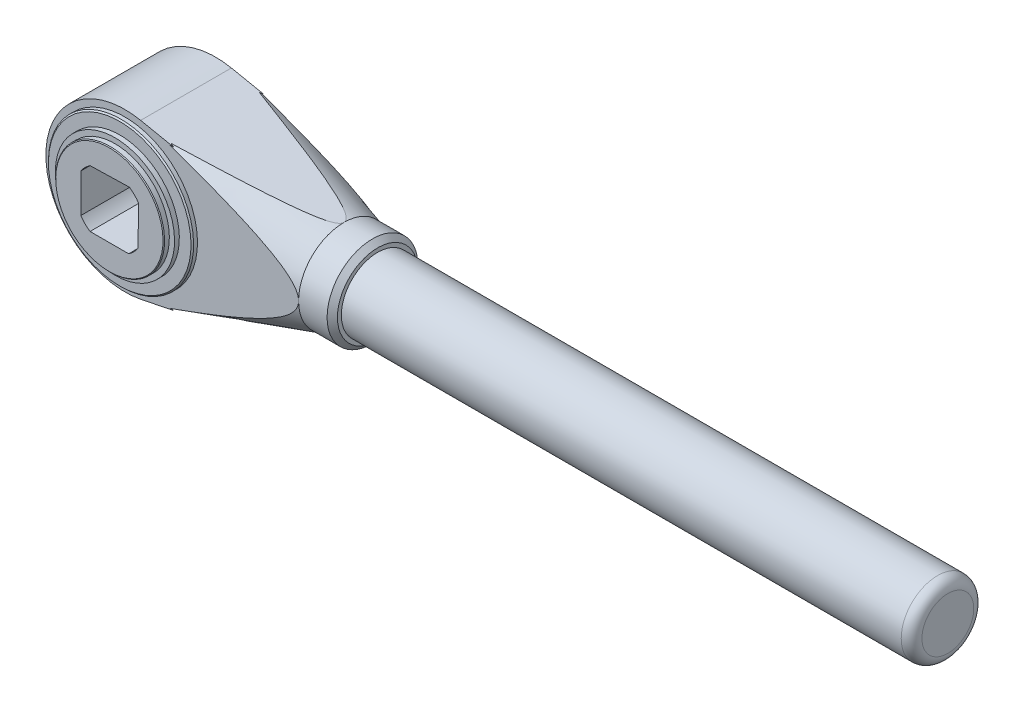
ISO-10303-21;
HEADER;
FILE_DESCRIPTION(('STEP AP214'),'2;1');
FILE_NAME('part.step','',(''),(''),'','','');
FILE_SCHEMA(('AUTOMOTIVE_DESIGN { 1 0 10303 214 1 1 1 1 }'));
ENDSEC;
DATA;
#1=APPLICATION_CONTEXT('core data for automotive mechanical design processes');
#2=APPLICATION_PROTOCOL_DEFINITION('international standard','automotive_design',2000,#1);
#3=PRODUCT_CONTEXT('',#1,'mechanical');
#4=PRODUCT('Part','Part','',(#3));
#5=PRODUCT_RELATED_PRODUCT_CATEGORY('part','',(#4));
#6=PRODUCT_DEFINITION_FORMATION('','',#4);
#7=PRODUCT_DEFINITION_CONTEXT('part definition',#1,'design');
#8=PRODUCT_DEFINITION('design','',#6,#7);
#9=PRODUCT_DEFINITION_SHAPE('','',#8);
#10=(LENGTH_UNIT() NAMED_UNIT(*) SI_UNIT(.MILLI.,.METRE.));
#11=(NAMED_UNIT(*) PLANE_ANGLE_UNIT() SI_UNIT($,.RADIAN.));
#12=(NAMED_UNIT(*) SI_UNIT($,.STERADIAN.) SOLID_ANGLE_UNIT());
#13=UNCERTAINTY_MEASURE_WITH_UNIT(LENGTH_MEASURE(1.E-05),#10,'distance_accuracy_value','');
#14=(GEOMETRIC_REPRESENTATION_CONTEXT(3) GLOBAL_UNCERTAINTY_ASSIGNED_CONTEXT((#13)) GLOBAL_UNIT_ASSIGNED_CONTEXT((#10,
#11,#12)) REPRESENTATION_CONTEXT('',''));
#15=CARTESIAN_POINT('',(0.,0.,0.));
#16=DIRECTION('',(0.,0.,1.));
#17=DIRECTION('',(1.,0.,0.));
#18=AXIS2_PLACEMENT_3D('',#15,#16,#17);
#19=CARTESIAN_POINT('',(0.,0.,41.));
#20=DIRECTION('',(0.,0.,1.));
#21=DIRECTION('',(1.,0.,0.));
#22=AXIS2_PLACEMENT_3D('',#19,#20,#21);
#23=PLANE('',#22);
#24=CARTESIAN_POINT('',(0.,0.,41.));
#25=DIRECTION('',(0.,0.,1.));
#26=DIRECTION('',(0.,-1.,0.));
#27=AXIS2_PLACEMENT_3D('',#24,#25,#26);
#28=CIRCLE('',#27,28.);
#29=CARTESIAN_POINT('',(0.,-28.,40.9999999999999));
#30=VERTEX_POINT('',#29);
#31=EDGE_CURVE('E307',#30,#30,#28,.T.);
#32=ORIENTED_EDGE('',*,*,#31,.F.);
#33=EDGE_LOOP('',(#32));
#34=FACE_BOUND('',#33,.T.);
#35=CARTESIAN_POINT('',(-20.3265463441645,-40.097454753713,41.));
#36=CARTESIAN_POINT('',(-18.4584616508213,-39.4847416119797,41.));
#37=CARTESIAN_POINT('',(-16.5910257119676,-38.8700442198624,41.));
#38=CARTESIAN_POINT('',(-12.8576894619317,-37.6359772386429,41.));
#39=CARTESIAN_POINT('',(-10.9917891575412,-37.0166076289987,41.));
#40=CARTESIAN_POINT('',(-7.26151584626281,-35.772410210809,41.));
#41=CARTESIAN_POINT('',(-5.39714309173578,-35.1475816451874,41.));
#42=CARTESIAN_POINT('',(-1.67051414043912,-33.8916497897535,41.));
#43=CARTESIAN_POINT('',(0.191742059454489,-33.2605465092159,41.));
#44=CARTESIAN_POINT('',(3.91007253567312,-31.9921982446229,41.));
#45=CARTESIAN_POINT('',(5.76615176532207,-31.35496779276,41.));
#46=CARTESIAN_POINT('',(9.47527619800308,-30.0717394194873,41.));
#47=CARTESIAN_POINT('',(11.3283214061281,-29.4257415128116,41.));
#48=CARTESIAN_POINT('',(15.0305717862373,-28.1232107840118,41.));
#49=CARTESIAN_POINT('',(16.8797772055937,-27.4666786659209,41.));
#50=CARTESIAN_POINT('',(20.5735293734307,-26.140658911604,41.));
#51=CARTESIAN_POINT('',(22.4180761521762,-25.471171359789,41.));
#52=CARTESIAN_POINT('',(26.0392404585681,-24.1388478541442,41.));
#53=CARTESIAN_POINT('',(27.8160542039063,-23.4765468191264,41.));
#54=CARTESIAN_POINT('',(30.4758988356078,-22.4687098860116,41.));
#55=CARTESIAN_POINT('',(31.3616514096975,-22.1303534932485,41.));
#56=CARTESIAN_POINT('',(33.1310528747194,-21.4481794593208,41.));
#57=CARTESIAN_POINT('',(34.0147017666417,-21.1043618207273,41.));
#58=CARTESIAN_POINT('',(35.7811728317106,-20.4098426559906,41.));
#59=CARTESIAN_POINT('',(36.6639904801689,-20.05912961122,41.));
#60=CARTESIAN_POINT('',(38.4267167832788,-19.3504676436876,41.));
#61=CARTESIAN_POINT('',(39.3066254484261,-18.9925187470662,41.));
#62=CARTESIAN_POINT('',(41.0628101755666,-18.2682493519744,41.));
#63=CARTESIAN_POINT('',(41.9390868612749,-17.901930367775,41.));
#64=CARTESIAN_POINT('',(43.6874206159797,-17.159357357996,41.));
#65=CARTESIAN_POINT('',(44.5594777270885,-16.7831034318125,41.));
#66=CARTESIAN_POINT('',(46.0771587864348,-16.1159562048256,41.));
#67=CARTESIAN_POINT('',(46.7239419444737,-15.8277012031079,41.));
#68=CARTESIAN_POINT('',(48.0140536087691,-15.2435671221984,41.));
#69=CARTESIAN_POINT('',(48.6573821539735,-14.9476881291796,41.));
#70=CARTESIAN_POINT('',(49.9402718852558,-14.3468684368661,41.));
#71=CARTESIAN_POINT('',(50.5798305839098,-14.0419224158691,41.));
#72=CARTESIAN_POINT('',(51.8538419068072,-13.4215570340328,41.));
#73=CARTESIAN_POINT('',(52.488294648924,-13.1061379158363,41.));
#74=CARTESIAN_POINT('',(53.7499512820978,-12.4632365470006,41.));
#75=CARTESIAN_POINT('',(54.3771641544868,-12.1357719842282,41.));
#76=CARTESIAN_POINT('',(55.6235393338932,-11.4656603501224,41.));
#77=CARTESIAN_POINT('',(56.2427007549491,-11.1230116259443,41.));
#78=CARTESIAN_POINT('',(57.4697347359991,-10.4193561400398,41.));
#79=CARTESIAN_POINT('',(58.0776184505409,-10.0583690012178,41.));
#80=CARTESIAN_POINT('',(58.9783694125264,-9.49919930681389,41.));
#81=CARTESIAN_POINT('',(59.2767441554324,-9.30988141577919,41.));
#82=CARTESIAN_POINT('',(59.8691018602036,-8.92450651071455,41.));
#83=CARTESIAN_POINT('',(60.1630849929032,-8.72844975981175,41.));
#84=CARTESIAN_POINT('',(60.8237408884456,-8.27514895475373,41.));
#85=CARTESIAN_POINT('',(61.1888197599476,-8.01556743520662,41.));
#86=CARTESIAN_POINT('',(61.9081473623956,-7.48150147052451,41.));
#87=CARTESIAN_POINT('',(62.2623926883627,-7.20701241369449,41.));
#88=CARTESIAN_POINT('',(62.9555720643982,-6.64063193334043,41.));
#89=CARTESIAN_POINT('',(63.2945370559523,-6.34877873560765,41.));
#90=CARTESIAN_POINT('',(63.9522441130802,-5.7433553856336,41.));
#91=CARTESIAN_POINT('',(64.2709996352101,-5.42979998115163,41.));
#92=CARTESIAN_POINT('',(64.8766412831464,-4.77946812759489,41.));
#93=CARTESIAN_POINT('',(65.1638557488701,-4.44300516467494,41.));
#94=CARTESIAN_POINT('',(65.5637805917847,-3.91482026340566,41.));
#95=CARTESIAN_POINT('',(65.6919555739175,-3.7348160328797,41.));
#96=CARTESIAN_POINT('',(65.9356294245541,-3.36645789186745,41.));
#97=CARTESIAN_POINT('',(66.051130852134,-3.17810567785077,41.));
#98=CARTESIAN_POINT('',(66.3324430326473,-2.6752463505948,41.));
#99=CARTESIAN_POINT('',(66.4861094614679,-2.35370481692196,41.));
#100=CARTESIAN_POINT('',(66.7393261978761,-1.69009608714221,41.));
#101=CARTESIAN_POINT('',(66.8389975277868,-1.3480767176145,41.));
#102=CARTESIAN_POINT('',(66.9614870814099,-0.702377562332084,41.));
#103=CARTESIAN_POINT('',(66.9934602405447,-0.400467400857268,41.));
#104=CARTESIAN_POINT('',(67.0047121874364,0.204366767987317,41.));
#105=CARTESIAN_POINT('',(66.983996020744,0.507290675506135,41.));
#106=CARTESIAN_POINT('',(66.8926790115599,1.10402389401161,41.));
#107=CARTESIAN_POINT('',(66.822277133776,1.39786469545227,41.));
#108=CARTESIAN_POINT('',(66.6392686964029,1.97202590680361,41.));
#109=CARTESIAN_POINT('',(66.5266254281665,2.25233431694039,41.));
#110=CARTESIAN_POINT('',(66.2864056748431,2.75810670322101,41.));
#111=CARTESIAN_POINT('',(66.1632181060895,2.98570800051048,41.));
#112=CARTESIAN_POINT('',(65.8972127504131,3.42924755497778,41.));
#113=CARTESIAN_POINT('',(65.7543807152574,3.64517718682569,41.));
#114=CARTESIAN_POINT('',(65.4528344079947,4.06647376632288,41.));
#115=CARTESIAN_POINT('',(65.2940755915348,4.27180851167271,41.));
#116=CARTESIAN_POINT('',(64.964285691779,4.67219764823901,41.));
#117=CARTESIAN_POINT('',(64.7932579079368,4.86725477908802,41.));
#118=CARTESIAN_POINT('',(64.363128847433,5.33294879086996,41.));
#119=CARTESIAN_POINT('',(64.0986769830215,5.59863169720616,41.));
#120=CARTESIAN_POINT('',(63.5545484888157,6.11402591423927,41.));
#121=CARTESIAN_POINT('',(63.2748636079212,6.36372840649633,41.));
#122=CARTESIAN_POINT('',(62.7034444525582,6.85004908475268,41.));
#123=CARTESIAN_POINT('',(62.4116873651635,7.086640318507,41.));
#124=CARTESIAN_POINT('',(61.819284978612,7.54823669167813,41.));
#125=CARTESIAN_POINT('',(61.5186413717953,7.77324401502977,41.));
#126=CARTESIAN_POINT('',(60.9082184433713,8.21488354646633,41.));
#127=CARTESIAN_POINT('',(60.5983914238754,8.43144957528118,41.));
#128=CARTESIAN_POINT('',(59.9729152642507,8.8560025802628,41.));
#129=CARTESIAN_POINT('',(59.6572658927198,9.06398921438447,41.));
#130=CARTESIAN_POINT('',(59.0215960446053,9.47225309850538,41.));
#131=CARTESIAN_POINT('',(58.7015816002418,9.67253976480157,41.));
#132=CARTESIAN_POINT('',(58.0575942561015,10.066603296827,41.));
#133=CARTESIAN_POINT('',(57.733621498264,10.2603803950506,41.));
#134=CARTESIAN_POINT('',(57.0425484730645,10.6655269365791,41.));
#135=CARTESIAN_POINT('',(56.6750136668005,10.8761543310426,41.));
#136=CARTESIAN_POINT('',(55.9363952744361,11.2911011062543,41.));
#137=CARTESIAN_POINT('',(55.565311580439,11.4954202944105,41.));
#138=CARTESIAN_POINT('',(54.4474744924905,12.1001175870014,41.));
#139=CARTESIAN_POINT('',(53.6962209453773,12.4921856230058,41.));
#140=CARTESIAN_POINT('',(52.1844372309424,13.2589833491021,41.));
#141=CARTESIAN_POINT('',(51.4239019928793,13.6337029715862,41.));
#142=CARTESIAN_POINT('',(49.8960301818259,14.3688513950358,41.));
#143=CARTESIAN_POINT('',(49.128694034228,14.7292810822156,41.));
#144=CARTESIAN_POINT('',(47.5868646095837,15.4391567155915,41.));
#145=CARTESIAN_POINT('',(46.8123590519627,15.788575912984,41.));
#146=CARTESIAN_POINT('',(45.2589407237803,16.4774860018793,41.));
#147=CARTESIAN_POINT('',(44.4800278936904,16.8169767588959,41.));
#148=CARTESIAN_POINT('',(42.9188348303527,17.4874088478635,41.));
#149=CARTESIAN_POINT('',(42.1365557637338,17.8183529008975,41.));
#150=CARTESIAN_POINT('',(40.5689671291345,18.4729938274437,41.));
#151=CARTESIAN_POINT('',(39.7836575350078,18.7966906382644,41.));
#152=CARTESIAN_POINT('',(38.210833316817,19.4376501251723,41.));
#153=CARTESIAN_POINT('',(37.4233198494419,19.7549156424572,41.));
#154=CARTESIAN_POINT('',(35.8460970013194,20.3839444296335,41.));
#155=CARTESIAN_POINT('',(35.0563876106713,20.6957076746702,41.));
#156=CARTESIAN_POINT('',(32.6843188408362,21.6237906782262,41.));
#157=CARTESIAN_POINT('',(31.0991220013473,22.2328618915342,41.));
#158=CARTESIAN_POINT('',(27.925110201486,23.4349135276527,41.));
#159=CARTESIAN_POINT('',(26.3363030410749,24.0279146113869,41.));
#160=CARTESIAN_POINT('',(23.9497016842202,24.9081373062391,41.));
#161=CARTESIAN_POINT('',(23.1536130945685,25.1999946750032,41.));
#162=CARTESIAN_POINT('',(21.5604123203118,25.7809023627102,41.));
#163=CARTESIAN_POINT('',(20.7633001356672,26.069952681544,41.));
#164=CARTESIAN_POINT('',(18.5053551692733,26.8846593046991,41.));
#165=CARTESIAN_POINT('',(17.0434419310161,27.4073221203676,41.));
#166=CARTESIAN_POINT('',(14.1170510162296,28.4454238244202,41.));
#167=CARTESIAN_POINT('',(12.6525733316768,28.9608626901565,41.));
#168=CARTESIAN_POINT('',(9.72143912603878,29.9855571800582,41.));
#169=CARTESIAN_POINT('',(8.25478258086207,30.4948127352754,41.));
#170=CARTESIAN_POINT('',(5.31962085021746,31.5079704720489,41.));
#171=CARTESIAN_POINT('',(3.85111566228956,32.0118726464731,41.));
#172=CARTESIAN_POINT('',(-0.556926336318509,33.5166648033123,41.));
#173=CARTESIAN_POINT('',(-3.49884164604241,34.5105888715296,41.));
#174=CARTESIAN_POINT('',(-9.38748070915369,36.4840888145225,41.));
#175=CARTESIAN_POINT('',(-12.3342044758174,37.4636646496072,41.));
#176=CARTESIAN_POINT('',(-16.7582991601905,38.9248612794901,41.));
#177=CARTESIAN_POINT('',(-18.2342593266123,39.4107591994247,41.));
#178=CARTESIAN_POINT('',(-21.1870215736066,40.3799817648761,41.));
#179=CARTESIAN_POINT('',(-22.6638236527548,40.8633064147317,41.));
#180=CARTESIAN_POINT('',(-27.0953651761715,42.309820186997,41.));
#181=CARTESIAN_POINT('',(-30.0512348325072,43.2695474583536,41.));
#182=CARTESIAN_POINT('',(-35.9653270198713,45.1814093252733,41.));
#183=CARTESIAN_POINT('',(-38.9235494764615,46.1335441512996,41.));
#184=CARTESIAN_POINT('',(-44.8420108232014,48.0315193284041,41.));
#185=CARTESIAN_POINT('',(-47.8022497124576,48.9773596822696,41.));
#186=CARTESIAN_POINT('',(-53.6642404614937,50.8445796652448,41.));
#187=CARTESIAN_POINT('',(-56.5659584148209,51.7660657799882,41.));
#188=CARTESIAN_POINT('',(-62.3707687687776,53.604699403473,41.));
#189=CARTESIAN_POINT('',(-65.2738611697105,54.5218469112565,41.));
#190=CARTESIAN_POINT('',(-73.984947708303,57.2677400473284,41.));
#191=CARTESIAN_POINT('',(-79.7946969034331,59.0909190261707,41.));
#192=CARTESIAN_POINT('',(-88.5088527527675,61.8163089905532,41.));
#193=CARTESIAN_POINT('',(-91.4119451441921,62.7227282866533,41.));
#194=CARTESIAN_POINT('',(-97.2189023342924,64.5330905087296,41.));
#195=CARTESIAN_POINT('',(-100.122767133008,65.4370334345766,41.));
#196=CARTESIAN_POINT('',(-105.931138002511,67.2427273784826,41.));
#197=CARTESIAN_POINT('',(-108.835644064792,68.1444784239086,41.));
#198=CARTESIAN_POINT('',(-114.645258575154,69.9460359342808,41.));
#199=CARTESIAN_POINT('',(-117.55036702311,70.8458423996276,41.));
#200=CARTESIAN_POINT('',(-120.455739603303,71.744794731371,41.));
#201=B_SPLINE_CURVE_WITH_KNOTS('',3,(#35,#36,#37,#38,#39,#40,#41,#42,#43,#44,#45,#46,#47,#48,
#49,#50,#51,#52,#53,#54,#55,#56,#57,#58,#59,#60,#61,#62,#63,#64,#65,#66,#67,#68,#69,#70,#71,#72,
#73,#74,#75,#76,#77,#78,#79,#80,#81,#82,#83,#84,#85,#86,#87,#88,#89,#90,#91,#92,#93,#94,#95,#96,
#97,#98,#99,#100,#101,#102,#103,#104,#105,#106,#107,#108,#109,#110,#111,#112,#113,#114,#115,
#116,#117,#118,#119,#120,#121,#122,#123,#124,#125,#126,#127,#128,#129,#130,#131,#132,#133,#134,
#135,#136,#137,#138,#139,#140,#141,#142,#143,#144,#145,#146,#147,#148,#149,#150,#151,#152,#153,
#154,#155,#156,#157,#158,#159,#160,#161,#162,#163,#164,#165,#166,#167,#168,#169,#170,#171,#172,
#173,#174,#175,#176,#177,#178,#179,#180,#181,#182,#183,#184,#185,#186,#187,#188,#189,#190,#191,
#192,#193,#194,#195,#196,#197,#198,#199,#200),.UNSPECIFIED.,.F.,.F.,(4,2,2,2,2,2,2,2,2,2,2,2,2,
2,2,2,2,2,2,2,2,2,2,2,2,2,2,2,2,2,2,2,2,2,2,2,2,2,2,2,2,2,2,2,2,2,2,2,2,2,2,2,2,2,2,2,2,2,2,2,2,
2,2,2,2,2,2,2,2,2,2,2,2,2,2,2,2,2,2,2,2,2,4),(0.,5.89800318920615,11.7960323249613,
17.6948928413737,23.593744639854,29.4809867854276,35.3682190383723,41.2550594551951,
47.1418615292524,52.8304701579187,55.6749915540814,58.5195116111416,61.3692738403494,
64.219025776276,67.0682661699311,69.9174780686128,72.0417664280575,74.1660307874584,
76.2915675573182,78.4170551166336,80.5395372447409,82.6622509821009,84.7827392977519,
85.842767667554,86.9027546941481,88.2463137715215,89.5902908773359,90.9314115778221,
92.2716297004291,93.5962165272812,94.2587001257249,94.9210497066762,95.9863698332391,
97.0492922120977,97.9557116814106,98.8620443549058,99.764768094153,100.668278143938,
101.443546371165,102.219379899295,102.997447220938,103.775306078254,104.899000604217,
106.023309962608,107.149850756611,108.276178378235,109.410048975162,110.543964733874,
111.67644660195,112.808887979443,114.079644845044,115.350440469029,117.892329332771,
120.435675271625,122.97886323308,125.527815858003,128.076802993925,130.624968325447,
133.173155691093,135.720191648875,138.267239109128,143.361667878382,148.449202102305,
150.99290354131,153.536605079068,158.194187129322,162.85178377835,167.509432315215,
172.167087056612,181.482866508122,190.798671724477,195.460321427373,200.121963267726,
209.445262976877,218.768278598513,228.091290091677,237.224846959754,246.358405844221,
264.6256944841,273.749611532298,282.873529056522,291.99733207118,301.121133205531),.UNSPECIFIED.);
#202=CARTESIAN_POINT('',(67.,0.,41.));
#203=VERTEX_POINT('',#202);
#204=CARTESIAN_POINT('',(17.3242917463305,27.305716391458,41.));
#205=VERTEX_POINT('',#204);
#206=EDGE_CURVE('E297',#203,#205,#201,.T.);
#207=ORIENTED_EDGE('',*,*,#206,.T.);
#208=DIRECTION('',(-1.,0.,0.));
#209=VECTOR('',#208,1.);
#210=CARTESIAN_POINT('',(24.9797944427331,27.305716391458,41.));
#211=LINE('',#210,#209);
#212=CARTESIAN_POINT('',(18.778217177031,27.305716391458,41.));
#213=VERTEX_POINT('',#212);
#214=EDGE_CURVE('E247',#205,#213,#211,.F.);
#215=ORIENTED_EDGE('',*,*,#214,.T.);
#216=DIRECTION('',(-0.979945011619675,0.199268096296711,0.));
#217=VECTOR('',#216,1.);
#218=CARTESIAN_POINT('',(67.,17.5,41.));
#219=LINE('',#218,#217);
#220=CARTESIAN_POINT('',(6.077677,29.888323,41.));
#221=VERTEX_POINT('',#220);
#222=EDGE_CURVE('E456',#213,#221,#219,.T.);
#223=ORIENTED_EDGE('',*,*,#222,.T.);
#224=CARTESIAN_POINT('',(0.,0.,41.));
#225=DIRECTION('',(0.,0.,1.));
#226=DIRECTION('',(1.,0.,0.));
#227=AXIS2_PLACEMENT_3D('',#224,#225,#226);
#228=CIRCLE('',#227,30.5000001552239);
#229=CARTESIAN_POINT('',(6.077677,-29.888323,41.));
#230=VERTEX_POINT('',#229);
#231=EDGE_CURVE('E459',#221,#230,#228,.T.);
#232=ORIENTED_EDGE('',*,*,#231,.T.);
#233=DIRECTION('',(-0.979945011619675,-0.199268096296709,0.));
#234=VECTOR('',#233,1.);
#235=CARTESIAN_POINT('',(67.,-17.5,41.));
#236=LINE('',#235,#234);
#237=CARTESIAN_POINT('',(18.7782171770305,-27.3057163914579,41.));
#238=VERTEX_POINT('',#237);
#239=EDGE_CURVE('E463',#238,#230,#236,.T.);
#240=ORIENTED_EDGE('',*,*,#239,.F.);
#241=DIRECTION('',(-1.,0.,0.));
#242=VECTOR('',#241,1.);
#243=CARTESIAN_POINT('',(24.9797944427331,-27.3057163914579,41.));
#244=LINE('',#243,#242);
#245=CARTESIAN_POINT('',(17.3242917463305,-27.3057163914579,41.));
#246=VERTEX_POINT('',#245);
#247=EDGE_CURVE('E243',#238,#246,#244,.T.);
#248=ORIENTED_EDGE('',*,*,#247,.T.);
#249=EDGE_CURVE('E305',#246,#203,#201,.T.);
#250=ORIENTED_EDGE('',*,*,#249,.T.);
#251=EDGE_LOOP('',(#207,#215,#223,#232,#240,#248,#250));
#252=FACE_BOUND('',#251,.T.);
#253=ADVANCED_FACE('F15',(#34,#252),#23,.T.);
#254=CARTESIAN_POINT('',(67.,17.5,41.));
#255=DIRECTION('',(-0.199268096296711,-0.979945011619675,0.));
#256=DIRECTION('',(0.979945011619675,-0.199268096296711,0.));
#257=AXIS2_PLACEMENT_3D('',#254,#255,#256);
#258=PLANE('',#257);
#259=CARTESIAN_POINT('',(153.060127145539,0.,23.5));
#260=DIRECTION('',(-0.199268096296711,-0.979945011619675,0.));
#261=DIRECTION('',(-0.979945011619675,0.199268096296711,0.));
#262=AXIS2_PLACEMENT_3D('',#259,#260,#261);
#263=ELLIPSE('',#262,162.756962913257,32.4322701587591);
#264=CARTESIAN_POINT('',(17.3242917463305,27.6013666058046,40.5298769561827));
#265=VERTEX_POINT('',#264);
#266=EDGE_CURVE('E242',#265,#213,#263,.F.);
#267=ORIENTED_EDGE('',*,*,#266,.F.);
#268=CARTESIAN_POINT('',(17.3240917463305,27.6014072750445,6.4700744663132));
#269=CARTESIAN_POINT('',(18.3882130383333,27.3850222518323,6.72854774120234));
#270=CARTESIAN_POINT('',(19.4521200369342,27.1686808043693,6.98794278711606));
#271=CARTESIAN_POINT('',(21.5794300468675,26.7361003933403,7.50890509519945));
#272=CARTESIAN_POINT('',(22.6428330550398,26.5198614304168,7.77047237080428));
#273=CARTESIAN_POINT('',(24.7707659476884,26.0871543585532,8.29652969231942));
#274=CARTESIAN_POINT('',(25.8352948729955,25.8706864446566,8.56102378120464));
#275=CARTESIAN_POINT('',(27.9636451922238,25.4378944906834,9.09294149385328));
#276=CARTESIAN_POINT('',(29.0274665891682,25.2215704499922,9.36036510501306));
#277=CARTESIAN_POINT('',(31.1934440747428,24.7811271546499,9.90858360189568));
#278=CARTESIAN_POINT('',(32.2955686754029,24.557014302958,10.189508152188));
#279=CARTESIAN_POINT('',(34.4987155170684,24.1090127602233,10.7558219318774));
#280=CARTESIAN_POINT('',(35.5997377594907,23.8851240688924,11.041211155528));
#281=CARTESIAN_POINT('',(37.7987141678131,23.4379705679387,11.6169925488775));
#282=CARTESIAN_POINT('',(38.8966704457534,23.2147053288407,11.9073763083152));
#283=CARTESIAN_POINT('',(41.0908078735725,22.768535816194,12.4948708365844));
#284=CARTESIAN_POINT('',(42.1869890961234,22.5456315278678,12.7919813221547));
#285=CARTESIAN_POINT('',(44.2056946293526,22.1351354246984,13.3475915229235));
#286=CARTESIAN_POINT('',(45.1285449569,21.947477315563,13.6048558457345));
#287=CARTESIAN_POINT('',(46.9723089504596,21.5725549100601,14.127040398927));
#288=CARTESIAN_POINT('',(47.8932223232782,21.3852906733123,14.391961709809));
#289=CARTESIAN_POINT('',(49.7364356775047,21.0104802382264,14.9327581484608));
#290=CARTESIAN_POINT('',(50.6587233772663,20.8229365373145,15.2086770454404));
#291=CARTESIAN_POINT('',(52.4990267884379,20.4487178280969,15.7733851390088));
#292=CARTESIAN_POINT('',(53.4170443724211,20.2620424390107,16.0621679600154));
#293=CARTESIAN_POINT('',(55.2296543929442,19.8934550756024,16.6517502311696));
#294=CARTESIAN_POINT('',(56.124353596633,19.7115213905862,16.9522037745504));
#295=CARTESIAN_POINT('',(57.4609223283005,19.4397352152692,17.421983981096));
#296=CARTESIAN_POINT('',(57.905955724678,19.3492393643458,17.5819231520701));
#297=CARTESIAN_POINT('',(58.7931729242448,19.1688271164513,17.909678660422));
#298=CARTESIAN_POINT('',(59.2353570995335,19.078910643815,18.0774939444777));
#299=CARTESIAN_POINT('',(60.1125312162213,18.9005406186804,18.4218291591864));
#300=CARTESIAN_POINT('',(60.5475503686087,18.8120811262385,18.5982710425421));
#301=CARTESIAN_POINT('',(61.4125420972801,18.6361883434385,18.9643145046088));
#302=CARTESIAN_POINT('',(61.8425117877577,18.5487556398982,19.1539232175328));
#303=CARTESIAN_POINT('',(62.693215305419,18.3757683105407,19.5504763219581));
#304=CARTESIAN_POINT('',(63.1139743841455,18.2902085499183,19.7573630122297));
#305=CARTESIAN_POINT('',(63.7348413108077,18.1639576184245,20.0873823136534));
#306=CARTESIAN_POINT('',(63.9399944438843,18.1222405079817,20.2006145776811));
#307=CARTESIAN_POINT('',(64.3456552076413,18.0397509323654,20.4354046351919));
#308=CARTESIAN_POINT('',(64.5461643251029,17.9989781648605,20.5569597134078));
#309=CARTESIAN_POINT('',(64.7971642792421,17.94793827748,20.7185142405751));
#310=CARTESIAN_POINT('',(64.8507358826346,17.9370446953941,20.7535541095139));
#311=CARTESIAN_POINT('',(64.9573136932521,17.9153725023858,20.8244961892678));
#312=CARTESIAN_POINT('',(65.0103200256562,17.9045938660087,20.8603982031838));
#313=CARTESIAN_POINT('',(65.1683594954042,17.872457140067,20.9694833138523));
#314=CARTESIAN_POINT('',(65.2724527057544,17.8512901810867,21.0440708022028));
#315=CARTESIAN_POINT('',(65.5798337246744,17.7887854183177,21.2741612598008));
#316=CARTESIAN_POINT('',(65.778615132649,17.7483639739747,21.4362377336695));
#317=CARTESIAN_POINT('',(66.1027535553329,17.6824516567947,21.7369344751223));
#318=CARTESIAN_POINT('',(66.2332545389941,17.655914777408,21.8697209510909));
#319=CARTESIAN_POINT('',(66.475716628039,17.6066110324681,22.1519816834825));
#320=CARTESIAN_POINT('',(66.5877330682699,17.5838329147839,22.3014038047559));
#321=CARTESIAN_POINT('',(66.7412665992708,17.5526124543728,22.5552144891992));
#322=CARTESIAN_POINT('',(66.7929091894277,17.5421111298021,22.6531345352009));
#323=CARTESIAN_POINT('',(66.8812723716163,17.5241428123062,22.8558307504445));
#324=CARTESIAN_POINT('',(66.918008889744,17.5166725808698,22.9605994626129));
#325=CARTESIAN_POINT('',(66.9727462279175,17.5055419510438,23.1766950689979));
#326=CARTESIAN_POINT('',(66.9905090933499,17.501929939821,23.2880871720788));
#327=CARTESIAN_POINT('',(67.0036331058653,17.4992612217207,23.5122174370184));
#328=CARTESIAN_POINT('',(66.9990132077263,17.5002006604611,23.6249543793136));
#329=CARTESIAN_POINT('',(66.9704818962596,17.5060023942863,23.8310521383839));
#330=CARTESIAN_POINT('',(66.9494595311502,17.5102772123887,23.924855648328));
#331=CARTESIAN_POINT('',(66.8939486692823,17.5215651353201,24.1081919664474));
#332=CARTESIAN_POINT('',(66.8594487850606,17.5285805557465,24.1977210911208));
#333=CARTESIAN_POINT('',(66.7537586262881,17.5500722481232,24.4281935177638));
#334=CARTESIAN_POINT('',(66.6733039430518,17.5664324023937,24.5646653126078));
#335=CARTESIAN_POINT('',(66.493568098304,17.6029810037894,24.8239464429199));
#336=CARTESIAN_POINT('',(66.3942277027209,17.623181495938,24.9467108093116));
#337=CARTESIAN_POINT('',(66.147347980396,17.6733835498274,25.2209246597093));
#338=CARTESIAN_POINT('',(65.9949660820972,17.7043698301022,25.3677634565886));
#339=CARTESIAN_POINT('',(65.677218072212,17.7689826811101,25.6462085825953));
#340=CARTESIAN_POINT('',(65.5118245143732,17.8026148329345,25.7777811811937));
#341=CARTESIAN_POINT('',(65.1717049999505,17.8717768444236,26.0300906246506));
#342=CARTESIAN_POINT('',(64.9969248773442,17.9073177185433,26.1507506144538));
#343=CARTESIAN_POINT('',(64.6419006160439,17.9795105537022,26.3828242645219));
#344=CARTESIAN_POINT('',(64.4616626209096,18.0161612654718,26.4942478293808));
#345=CARTESIAN_POINT('',(64.0795316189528,18.0938661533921,26.7203171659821));
#346=CARTESIAN_POINT('',(63.8772277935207,18.1350038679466,26.8342356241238));
#347=CARTESIAN_POINT('',(63.4690372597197,18.2180078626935,27.0552073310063));
#348=CARTESIAN_POINT('',(63.263149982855,18.2598742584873,27.1622594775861));
#349=CARTESIAN_POINT('',(62.6412332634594,18.3863386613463,27.4752257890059));
#350=CARTESIAN_POINT('',(62.2211867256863,18.4717535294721,27.6728139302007));
#351=CARTESIAN_POINT('',(61.3734370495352,18.6441402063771,28.0530031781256));
#352=CARTESIAN_POINT('',(60.9457167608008,18.7311155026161,28.2355637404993));
#353=CARTESIAN_POINT('',(60.0858817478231,18.9059596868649,28.5890684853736));
#354=CARTESIAN_POINT('',(59.6537685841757,18.9938282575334,28.7600166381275));
#355=CARTESIAN_POINT('',(58.7851262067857,19.1704633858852,29.0934639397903));
#356=CARTESIAN_POINT('',(58.348588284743,19.2592317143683,29.25593932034));
#357=CARTESIAN_POINT('',(57.4730087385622,19.4372774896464,29.573801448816));
#358=CARTESIAN_POINT('',(57.0339669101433,19.5265549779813,29.7291876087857));
#359=CARTESIAN_POINT('',(56.1546731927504,19.7053560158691,30.0339409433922));
#360=CARTESIAN_POINT('',(55.7144243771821,19.7948789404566,30.1833173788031));
#361=CARTESIAN_POINT('',(54.8324153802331,19.9742321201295,30.4772883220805));
#362=CARTESIAN_POINT('',(54.3906552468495,20.0640623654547,30.6218829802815));
#363=CARTESIAN_POINT('',(53.1837717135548,20.3094775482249,31.0108978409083));
#364=CARTESIAN_POINT('',(52.4174173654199,20.4653127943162,31.2513402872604));
#365=CARTESIAN_POINT('',(50.8820085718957,20.7775323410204,31.7230949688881));
#366=CARTESIAN_POINT('',(50.1129540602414,20.933916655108,31.954406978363));
#367=CARTESIAN_POINT('',(48.5727325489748,21.2471148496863,32.4098311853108));
#368=CARTESIAN_POINT('',(47.8015653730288,21.4039287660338,32.6339427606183));
#369=CARTESIAN_POINT('',(46.2576222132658,21.7178837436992,33.0763263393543));
#370=CARTESIAN_POINT('',(45.4848462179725,21.8750248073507,33.2945983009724));
#371=CARTESIAN_POINT('',(43.1629085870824,22.3471820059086,33.9427353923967));
#372=CARTESIAN_POINT('',(41.6118249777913,22.6625889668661,34.3654281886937));
#373=CARTESIAN_POINT('',(38.5062922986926,23.2940872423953,35.1973364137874));
#374=CARTESIAN_POINT('',(36.9518433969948,23.6101785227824,35.6065524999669));
#375=CARTESIAN_POINT('',(33.8922948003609,24.2323261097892,36.4015152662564));
#376=CARTESIAN_POINT('',(32.3872767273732,24.5383658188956,36.7875896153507));
#377=CARTESIAN_POINT('',(29.3754595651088,25.1508074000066,37.5525301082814));
#378=CARTESIAN_POINT('',(27.8686604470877,25.4572092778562,37.9313961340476));
#379=CARTESIAN_POINT('',(24.8561627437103,26.0697892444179,38.6828204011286));
#380=CARTESIAN_POINT('',(23.3504663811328,26.3759668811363,39.0553879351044));
#381=CARTESIAN_POINT('',(20.3380159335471,26.9885372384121,39.795878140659));
#382=CARTESIAN_POINT('',(18.8312618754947,27.2949299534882,40.163800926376));
#383=CARTESIAN_POINT('',(17.3240917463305,27.6014072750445,40.5299255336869));
#384=B_SPLINE_CURVE_WITH_KNOTS('',3,(#268,#269,#270,#271,#272,#273,#274,#275,#276,#277,#278,
#279,#280,#281,#282,#283,#284,#285,#286,#287,#288,#289,#290,#291,#292,#293,#294,#295,#296,#297,
#298,#299,#300,#301,#302,#303,#304,#305,#306,#307,#308,#309,#310,#311,#312,#313,#314,#315,#316,
#317,#318,#319,#320,#321,#322,#323,#324,#325,#326,#327,#328,#329,#330,#331,#332,#333,#334,#335,
#336,#337,#338,#339,#340,#341,#342,#343,#344,#345,#346,#347,#348,#349,#350,#351,#352,#353,#354,
#355,#356,#357,#358,#359,#360,#361,#362,#363,#364,#365,#366,#367,#368,#369,#370,#371,#372,#373,
#374,#375,#376,#377,#378,#379,#380,#381,#382,#383),.UNSPECIFIED.,.F.,.F.,(4,2,2,2,2,2,2,2,2,2,2,
2,2,2,2,2,2,2,2,2,2,2,2,2,2,2,2,2,2,2,2,2,2,2,2,2,2,2,2,2,2,2,2,2,2,2,2,2,2,2,2,2,2,2,2,2,2,4),
(0.,3.3487116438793,6.69744401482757,10.0515925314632,13.4057266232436,16.8834215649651,
20.3611120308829,23.833429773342,27.3056015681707,30.2343099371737,33.1634336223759,
36.1056842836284,39.046492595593,41.9297313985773,43.3741217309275,44.8183194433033,
46.2512599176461,47.6849829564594,49.1140960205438,49.8280064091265,50.541684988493,
50.7364807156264,50.9312323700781,51.3205927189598,52.0979074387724,52.6611388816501,
53.2226523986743,53.5552963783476,53.887584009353,54.223991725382,54.5601146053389,
54.8475869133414,55.1353026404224,55.6103195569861,56.0868516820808,56.7268907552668,
57.3683180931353,58.0139588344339,58.6588980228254,59.3660968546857,60.0734089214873,
61.4888662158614,62.9080251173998,64.3266963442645,65.7491540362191,67.1717294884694,
68.5920215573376,70.0122689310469,72.4666859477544,74.9211636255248,77.375852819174,
79.8305595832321,84.7453473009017,89.6598949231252,94.4106759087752,99.1615346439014,
103.904633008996,108.64761459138),.UNSPECIFIED.);
#385=CARTESIAN_POINT('',(67.,17.5,23.5));
#386=VERTEX_POINT('',#385);
#387=EDGE_CURVE('E262',#386,#265,#384,.T.);
#388=ORIENTED_EDGE('',*,*,#387,.F.);
#389=CARTESIAN_POINT('',(17.3242917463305,27.6013666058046,6.47012304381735));
#390=VERTEX_POINT('',#389);
#391=EDGE_CURVE('E306',#390,#386,#384,.T.);
#392=ORIENTED_EDGE('',*,*,#391,.F.);
#393=CARTESIAN_POINT('',(18.7782171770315,27.305716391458,6.));
#394=VERTEX_POINT('',#393);
#395=EDGE_CURVE('E238',#394,#390,#263,.F.);
#396=ORIENTED_EDGE('',*,*,#395,.F.);
#397=DIRECTION('',(-0.979945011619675,0.199268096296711,0.));
#398=VECTOR('',#397,1.);
#399=CARTESIAN_POINT('',(67.,17.5,6.));
#400=LINE('',#399,#398);
#401=CARTESIAN_POINT('',(6.077677,29.888323,6.));
#402=VERTEX_POINT('',#401);
#403=EDGE_CURVE('E446',#394,#402,#400,.T.);
#404=ORIENTED_EDGE('',*,*,#403,.T.);
#405=DIRECTION('',(0.,0.,-1.));
#406=VECTOR('',#405,1.);
#407=CARTESIAN_POINT('',(6.077677,29.888323,41.));
#408=LINE('',#407,#406);
#409=EDGE_CURVE('E470',#221,#402,#408,.T.);
#410=ORIENTED_EDGE('',*,*,#409,.F.);
#411=ORIENTED_EDGE('',*,*,#222,.F.);
#412=EDGE_LOOP('',(#267,#388,#392,#396,#404,#410,#411));
#413=FACE_BOUND('',#412,.T.);
#414=ADVANCED_FACE('F311',(#413),#258,.F.);
#415=CARTESIAN_POINT('',(67.,-17.5,41.));
#416=DIRECTION('',(0.199268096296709,-0.979945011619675,0.));
#417=DIRECTION('',(0.979945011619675,0.199268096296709,0.));
#418=AXIS2_PLACEMENT_3D('',#415,#416,#417);
#419=PLANE('',#418);
#420=CARTESIAN_POINT('',(17.3240917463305,-27.6014072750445,6.47007446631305));
#421=CARTESIAN_POINT('',(18.3882130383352,-27.3850222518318,6.72854774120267));
#422=CARTESIAN_POINT('',(19.4521200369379,-27.1686808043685,6.98794278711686));
#423=CARTESIAN_POINT('',(21.5794300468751,-26.7361003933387,7.5089050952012));
#424=CARTESIAN_POINT('',(22.6428330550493,-26.5198614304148,7.77047237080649));
#425=CARTESIAN_POINT('',(24.7707659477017,-26.0871543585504,8.2965296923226));
#426=CARTESIAN_POINT('',(25.8352948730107,-25.8706864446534,8.56102378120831));
#427=CARTESIAN_POINT('',(27.9636451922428,-25.4378944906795,9.09294149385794));
#428=CARTESIAN_POINT('',(29.0274665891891,-25.2215704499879,9.36036510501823));
#429=CARTESIAN_POINT('',(31.1934440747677,-24.7811271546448,9.90858360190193));
#430=CARTESIAN_POINT('',(32.29556867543,-24.5570143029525,10.1895081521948));
#431=CARTESIAN_POINT('',(34.4987155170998,-24.1090127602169,10.7558219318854));
#432=CARTESIAN_POINT('',(35.5997377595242,-23.8851240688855,11.0412111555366));
#433=CARTESIAN_POINT('',(37.7987141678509,-23.437970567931,11.6169925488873));
#434=CARTESIAN_POINT('',(38.8966704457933,-23.2147053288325,11.9073763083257));
#435=CARTESIAN_POINT('',(41.0908078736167,-22.768535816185,12.4948708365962));
#436=CARTESIAN_POINT('',(42.1869890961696,-22.5456315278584,12.7919813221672));
#437=CARTESIAN_POINT('',(44.2056946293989,-22.1351354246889,13.3475915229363));
#438=CARTESIAN_POINT('',(45.1285449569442,-21.947477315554,13.6048558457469));
#439=CARTESIAN_POINT('',(46.9723089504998,-21.5725549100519,14.1270403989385));
#440=CARTESIAN_POINT('',(47.8932223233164,-21.3852906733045,14.3919617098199));
#441=CARTESIAN_POINT('',(49.7364356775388,-21.0104802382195,14.9327581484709));
#442=CARTESIAN_POINT('',(50.6587233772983,-20.822936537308,15.20867704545));
#443=CARTESIAN_POINT('',(52.4990267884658,-20.4487178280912,15.7733851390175));
#444=CARTESIAN_POINT('',(53.4170443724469,-20.2620424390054,16.0621679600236));
#445=CARTESIAN_POINT('',(55.2296543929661,-19.8934550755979,16.6517502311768));
#446=CARTESIAN_POINT('',(56.1243535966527,-19.7115213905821,16.9522037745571));
#447=CARTESIAN_POINT('',(57.4609223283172,-19.4397352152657,17.4219839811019));
#448=CARTESIAN_POINT('',(57.9059557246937,-19.3492393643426,17.5819231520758));
#449=CARTESIAN_POINT('',(58.7931729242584,-19.1688271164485,17.9096786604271));
#450=CARTESIAN_POINT('',(59.2353570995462,-19.0789106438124,18.0774939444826));
#451=CARTESIAN_POINT('',(60.1125312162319,-18.9005406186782,18.4218291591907));
#452=CARTESIAN_POINT('',(60.5475503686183,-18.8120811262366,18.5982710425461));
#453=CARTESIAN_POINT('',(61.4125420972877,-18.636188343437,18.9643145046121));
#454=CARTESIAN_POINT('',(61.8425117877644,-18.5487556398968,19.1539232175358));
#455=CARTESIAN_POINT('',(62.6932153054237,-18.3757683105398,19.5504763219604));
#456=CARTESIAN_POINT('',(63.1139743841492,-18.2902085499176,19.7573630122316));
#457=CARTESIAN_POINT('',(63.73484131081,-18.163957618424,20.0873823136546));
#458=CARTESIAN_POINT('',(63.9399944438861,-18.1222405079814,20.2006145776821));
#459=CARTESIAN_POINT('',(64.3456552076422,-18.0397509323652,20.4354046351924));
#460=CARTESIAN_POINT('',(64.5461643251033,-17.9989781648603,20.556959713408));
#461=CARTESIAN_POINT('',(64.7971642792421,-17.9479382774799,20.7185142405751));
#462=CARTESIAN_POINT('',(64.8507358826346,-17.9370446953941,20.7535541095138));
#463=CARTESIAN_POINT('',(64.9573136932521,-17.9153725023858,20.8244961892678));
#464=CARTESIAN_POINT('',(65.0103200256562,-17.9045938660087,20.8603982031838));
#465=CARTESIAN_POINT('',(65.1683594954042,-17.872457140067,20.9694833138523));
#466=CARTESIAN_POINT('',(65.2724527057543,-17.8512901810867,21.0440708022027));
#467=CARTESIAN_POINT('',(65.5798337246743,-17.7887854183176,21.2741612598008));
#468=CARTESIAN_POINT('',(65.778615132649,-17.7483639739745,21.4362377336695));
#469=CARTESIAN_POINT('',(66.1027535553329,-17.6824516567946,21.7369344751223));
#470=CARTESIAN_POINT('',(66.233254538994,-17.655914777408,21.8697209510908));
#471=CARTESIAN_POINT('',(66.475716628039,-17.6066110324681,22.1519816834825));
#472=CARTESIAN_POINT('',(66.5877330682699,-17.5838329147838,22.3014038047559));
#473=CARTESIAN_POINT('',(66.7412665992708,-17.5526124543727,22.5552144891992));
#474=CARTESIAN_POINT('',(66.7929091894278,-17.5421111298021,22.6531345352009));
#475=CARTESIAN_POINT('',(66.8812723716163,-17.5241428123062,22.8558307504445));
#476=CARTESIAN_POINT('',(66.918008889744,-17.5166725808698,22.9605994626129));
#477=CARTESIAN_POINT('',(66.9727462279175,-17.5055419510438,23.1766950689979));
#478=CARTESIAN_POINT('',(66.9905090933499,-17.501929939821,23.2880871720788));
#479=CARTESIAN_POINT('',(67.0036331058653,-17.4992612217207,23.5122174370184));
#480=CARTESIAN_POINT('',(66.9990132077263,-17.500200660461,23.6249543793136));
#481=CARTESIAN_POINT('',(66.9704818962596,-17.5060023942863,23.8310521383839));
#482=CARTESIAN_POINT('',(66.9494595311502,-17.5102772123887,23.9248556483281));
#483=CARTESIAN_POINT('',(66.8939486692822,-17.5215651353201,24.1081919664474));
#484=CARTESIAN_POINT('',(66.8594487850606,-17.5285805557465,24.1977210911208));
#485=CARTESIAN_POINT('',(66.7537586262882,-17.5500722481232,24.4281935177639));
#486=CARTESIAN_POINT('',(66.6733039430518,-17.5664324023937,24.5646653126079));
#487=CARTESIAN_POINT('',(66.493568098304,-17.6029810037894,24.8239464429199));
#488=CARTESIAN_POINT('',(66.3942277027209,-17.623181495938,24.9467108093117));
#489=CARTESIAN_POINT('',(66.147347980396,-17.6733835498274,25.2209246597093));
#490=CARTESIAN_POINT('',(65.9949660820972,-17.7043698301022,25.3677634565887));
#491=CARTESIAN_POINT('',(65.6772180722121,-17.7689826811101,25.6462085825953));
#492=CARTESIAN_POINT('',(65.5118245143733,-17.8026148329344,25.7777811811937));
#493=CARTESIAN_POINT('',(65.1717049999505,-17.8717768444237,26.0300906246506));
#494=CARTESIAN_POINT('',(64.9969248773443,-17.9073177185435,26.1507506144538));
#495=CARTESIAN_POINT('',(64.6419006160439,-17.979510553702,26.3828242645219));
#496=CARTESIAN_POINT('',(64.4616626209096,-18.0161612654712,26.4942478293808));
#497=CARTESIAN_POINT('',(64.0795316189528,-18.0938661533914,26.7203171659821));
#498=CARTESIAN_POINT('',(63.8772277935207,-18.1350038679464,26.8342356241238));
#499=CARTESIAN_POINT('',(63.4690372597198,-18.2180078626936,27.0552073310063));
#500=CARTESIAN_POINT('',(63.2631499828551,-18.2598742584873,27.1622594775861));
#501=CARTESIAN_POINT('',(62.6412332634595,-18.3863386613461,27.4752257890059));
#502=CARTESIAN_POINT('',(62.2211867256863,-18.471753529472,27.6728139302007));
#503=CARTESIAN_POINT('',(61.3734370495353,-18.6441402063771,28.0530031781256));
#504=CARTESIAN_POINT('',(60.9457167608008,-18.7311155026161,28.2355637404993));
#505=CARTESIAN_POINT('',(60.0858817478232,-18.9059596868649,28.5890684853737));
#506=CARTESIAN_POINT('',(59.6537685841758,-18.9938282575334,28.7600166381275));
#507=CARTESIAN_POINT('',(58.7851262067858,-19.1704633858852,29.0934639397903));
#508=CARTESIAN_POINT('',(58.348588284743,-19.2592317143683,29.25593932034));
#509=CARTESIAN_POINT('',(57.4730087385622,-19.4372774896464,29.573801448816));
#510=CARTESIAN_POINT('',(57.0339669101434,-19.5265549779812,29.7291876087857));
#511=CARTESIAN_POINT('',(56.1546731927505,-19.705356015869,30.0339409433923));
#512=CARTESIAN_POINT('',(55.7144243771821,-19.7948789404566,30.1833173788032));
#513=CARTESIAN_POINT('',(54.8324153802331,-19.9742321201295,30.4772883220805));
#514=CARTESIAN_POINT('',(54.3906552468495,-20.0640623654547,30.6218829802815));
#515=CARTESIAN_POINT('',(53.1837717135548,-20.3094775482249,31.0108978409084));
#516=CARTESIAN_POINT('',(52.4174173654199,-20.4653127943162,31.2513402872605));
#517=CARTESIAN_POINT('',(50.8820085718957,-20.7775323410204,31.7230949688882));
#518=CARTESIAN_POINT('',(50.1129540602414,-20.933916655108,31.9544069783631));
#519=CARTESIAN_POINT('',(48.5727325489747,-21.2471148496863,32.4098311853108));
#520=CARTESIAN_POINT('',(47.8015653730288,-21.4039287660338,32.6339427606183));
#521=CARTESIAN_POINT('',(46.2576222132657,-21.7178837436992,33.0763263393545));
#522=CARTESIAN_POINT('',(45.4848462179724,-21.8750248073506,33.2945983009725));
#523=CARTESIAN_POINT('',(43.1629085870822,-22.3471820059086,33.9427353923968));
#524=CARTESIAN_POINT('',(41.6118249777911,-22.6625889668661,34.3654281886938));
#525=CARTESIAN_POINT('',(38.5062922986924,-23.2940872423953,35.1973364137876));
#526=CARTESIAN_POINT('',(36.9518433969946,-23.6101785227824,35.606552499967));
#527=CARTESIAN_POINT('',(33.8922948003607,-24.2323261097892,36.4015152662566));
#528=CARTESIAN_POINT('',(32.3872767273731,-24.5383658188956,36.7875896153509));
#529=CARTESIAN_POINT('',(29.3754595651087,-25.1508074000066,37.5525301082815));
#530=CARTESIAN_POINT('',(27.8686604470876,-25.4572092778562,37.9313961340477));
#531=CARTESIAN_POINT('',(24.8561627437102,-26.0697892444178,38.6828204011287));
#532=CARTESIAN_POINT('',(23.3504663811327,-26.3759668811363,39.0553879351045));
#533=CARTESIAN_POINT('',(20.3380159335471,-26.9885372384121,39.7958781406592));
#534=CARTESIAN_POINT('',(18.8312618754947,-27.2949299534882,40.1638009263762));
#535=CARTESIAN_POINT('',(17.3240917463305,-27.6014072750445,40.5299255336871));
#536=B_SPLINE_CURVE_WITH_KNOTS('',3,(#420,#421,#422,#423,#424,#425,#426,#427,#428,#429,#430,
#431,#432,#433,#434,#435,#436,#437,#438,#439,#440,#441,#442,#443,#444,#445,#446,#447,#448,#449,
#450,#451,#452,#453,#454,#455,#456,#457,#458,#459,#460,#461,#462,#463,#464,#465,#466,#467,#468,
#469,#470,#471,#472,#473,#474,#475,#476,#477,#478,#479,#480,#481,#482,#483,#484,#485,#486,#487,
#488,#489,#490,#491,#492,#493,#494,#495,#496,#497,#498,#499,#500,#501,#502,#503,#504,#505,#506,
#507,#508,#509,#510,#511,#512,#513,#514,#515,#516,#517,#518,#519,#520,#521,#522,#523,#524,#525,
#526,#527,#528,#529,#530,#531,#532,#533,#534,#535),.UNSPECIFIED.,.F.,.F.,(4,2,2,2,2,2,2,2,2,2,2,
2,2,2,2,2,2,2,2,2,2,2,2,2,2,2,2,2,2,2,2,2,2,2,2,2,2,2,2,2,2,2,2,2,2,2,2,2,2,2,2,2,2,2,2,2,2,4),
(0.,3.34871164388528,6.69744401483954,10.0515925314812,13.4057266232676,16.8834215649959,
20.3611120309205,23.8334297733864,27.3056015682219,30.2343099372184,33.1634336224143,
36.1056842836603,39.0464925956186,41.9297313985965,43.3741217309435,44.8183194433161,
46.2512599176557,47.6849829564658,49.1140960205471,49.8280064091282,50.5416849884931,
50.7364807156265,50.9312323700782,51.3205927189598,52.0979074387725,52.6611388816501,
53.2226523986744,53.5552963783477,53.8875840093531,54.2239917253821,54.560114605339,
54.8475869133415,55.1353026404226,55.6103195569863,56.0868516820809,56.7268907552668,
57.3683180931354,58.013958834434,58.6588980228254,59.3660968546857,60.0734089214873,
61.4888662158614,62.9080251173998,64.3266963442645,65.7491540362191,67.1717294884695,
68.5920215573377,70.012268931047,72.4666859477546,74.921163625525,77.3758528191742,
79.8305595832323,84.745347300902,89.6598949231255,94.4106759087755,99.1615346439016,
103.904633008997,108.64761459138),.UNSPECIFIED.);
#537=CARTESIAN_POINT('',(67.,-17.5,23.5));
#538=VERTEX_POINT('',#537);
#539=CARTESIAN_POINT('',(17.3242917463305,-27.6013666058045,40.5298769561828));
#540=VERTEX_POINT('',#539);
#541=EDGE_CURVE('E251',#538,#540,#536,.T.);
#542=ORIENTED_EDGE('',*,*,#541,.T.);
#543=CARTESIAN_POINT('',(153.060127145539,0.,23.5));
#544=DIRECTION('',(0.199268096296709,-0.979945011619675,0.));
#545=DIRECTION('',(-0.979945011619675,-0.199268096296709,0.));
#546=AXIS2_PLACEMENT_3D('',#543,#544,#545);
#547=ELLIPSE('',#546,162.756962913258,32.4322701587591);
#548=EDGE_CURVE('E239',#540,#238,#547,.F.);
#549=ORIENTED_EDGE('',*,*,#548,.T.);
#550=ORIENTED_EDGE('',*,*,#239,.T.);
#551=DIRECTION('',(0.,0.,-1.));
#552=VECTOR('',#551,1.);
#553=CARTESIAN_POINT('',(6.077677,-29.888323,41.));
#554=LINE('',#553,#552);
#555=CARTESIAN_POINT('',(6.077677,-29.888323,6.));
#556=VERTEX_POINT('',#555);
#557=EDGE_CURVE('E466',#230,#556,#554,.T.);
#558=ORIENTED_EDGE('',*,*,#557,.T.);
#559=DIRECTION('',(-0.979945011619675,-0.199268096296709,0.));
#560=VECTOR('',#559,1.);
#561=CARTESIAN_POINT('',(67.,-17.5,6.));
#562=LINE('',#561,#560);
#563=CARTESIAN_POINT('',(18.778217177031,-27.3057163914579,6.));
#564=VERTEX_POINT('',#563);
#565=EDGE_CURVE('E453',#564,#556,#562,.T.);
#566=ORIENTED_EDGE('',*,*,#565,.F.);
#567=CARTESIAN_POINT('',(17.3242917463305,-27.6013666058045,6.47012304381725));
#568=VERTEX_POINT('',#567);
#569=EDGE_CURVE('E233',#564,#568,#547,.F.);
#570=ORIENTED_EDGE('',*,*,#569,.T.);
#571=EDGE_CURVE('E261',#568,#538,#536,.T.);
#572=ORIENTED_EDGE('',*,*,#571,.T.);
#573=EDGE_LOOP('',(#542,#549,#550,#558,#566,#570,#572));
#574=FACE_BOUND('',#573,.T.);
#575=ADVANCED_FACE('F269',(#574),#419,.T.);
#576=CARTESIAN_POINT('',(0.,0.,6.));
#577=DIRECTION('',(0.,0.,1.));
#578=DIRECTION('',(1.,0.,0.));
#579=AXIS2_PLACEMENT_3D('',#576,#577,#578);
#580=PLANE('',#579);
#581=CARTESIAN_POINT('',(0.,0.,6.));
#582=DIRECTION('',(0.,0.,1.));
#583=DIRECTION('',(0.,-1.,0.));
#584=AXIS2_PLACEMENT_3D('',#581,#582,#583);
#585=CIRCLE('',#584,28.);
#586=CARTESIAN_POINT('',(0.,-28.,5.99999999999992));
#587=VERTEX_POINT('',#586);
#588=EDGE_CURVE('E442',#587,#587,#585,.T.);
#589=ORIENTED_EDGE('',*,*,#588,.T.);
#590=EDGE_LOOP('',(#589));
#591=FACE_BOUND('',#590,.T.);
#592=DIRECTION('',(-1.,0.,0.));
#593=VECTOR('',#592,1.);
#594=CARTESIAN_POINT('',(24.9797944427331,27.305716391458,6.));
#595=LINE('',#594,#593);
#596=CARTESIAN_POINT('',(17.3242917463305,27.305716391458,6.));
#597=VERTEX_POINT('',#596);
#598=EDGE_CURVE('E9',#597,#394,#595,.F.);
#599=ORIENTED_EDGE('',*,*,#598,.F.);
#600=CARTESIAN_POINT('',(-20.3265463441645,-40.097454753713,6.));
#601=CARTESIAN_POINT('',(-18.4584616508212,-39.4847416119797,6.));
#602=CARTESIAN_POINT('',(-16.5910257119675,-38.8700442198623,6.));
#603=CARTESIAN_POINT('',(-12.8576894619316,-37.6359772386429,6.));
#604=CARTESIAN_POINT('',(-10.9917891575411,-37.0166076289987,6.));
#605=CARTESIAN_POINT('',(-7.26151584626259,-35.7724102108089,6.));
#606=CARTESIAN_POINT('',(-5.39714309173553,-35.1475816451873,6.));
#607=CARTESIAN_POINT('',(-1.67051414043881,-33.8916497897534,6.));
#608=CARTESIAN_POINT('',(0.191742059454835,-33.2605465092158,6.));
#609=CARTESIAN_POINT('',(3.91007253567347,-31.9921982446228,6.));
#610=CARTESIAN_POINT('',(5.76615176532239,-31.3549677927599,6.));
#611=CARTESIAN_POINT('',(9.47527619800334,-30.0717394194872,6.));
#612=CARTESIAN_POINT('',(11.3283214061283,-29.4257415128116,6.));
#613=CARTESIAN_POINT('',(15.0305717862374,-28.1232107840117,6.));
#614=CARTESIAN_POINT('',(16.8797772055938,-27.4666786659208,6.));
#615=CARTESIAN_POINT('',(20.5735293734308,-26.1406589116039,6.));
#616=CARTESIAN_POINT('',(22.4180761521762,-25.471171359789,6.));
#617=CARTESIAN_POINT('',(26.039240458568,-24.1388478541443,6.));
#618=CARTESIAN_POINT('',(27.816054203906,-23.4765468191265,6.));
#619=CARTESIAN_POINT('',(30.4758988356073,-22.4687098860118,6.));
#620=CARTESIAN_POINT('',(31.3616514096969,-22.1303534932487,6.));
#621=CARTESIAN_POINT('',(33.1310528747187,-21.4481794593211,6.));
#622=CARTESIAN_POINT('',(34.014701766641,-21.1043618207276,6.));
#623=CARTESIAN_POINT('',(35.7811728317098,-20.4098426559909,6.));
#624=CARTESIAN_POINT('',(36.663990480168,-20.0591296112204,6.));
#625=CARTESIAN_POINT('',(38.4267167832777,-19.350467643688,6.));
#626=CARTESIAN_POINT('',(39.306625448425,-18.9925187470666,6.));
#627=CARTESIAN_POINT('',(41.0628101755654,-18.2682493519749,6.));
#628=CARTESIAN_POINT('',(41.9390868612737,-17.9019303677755,6.));
#629=CARTESIAN_POINT('',(43.6874206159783,-17.1593573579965,6.));
#630=CARTESIAN_POINT('',(44.559477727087,-16.783103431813,6.));
#631=CARTESIAN_POINT('',(46.0771587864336,-16.115956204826,6.));
#632=CARTESIAN_POINT('',(46.7239419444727,-15.8277012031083,6.));
#633=CARTESIAN_POINT('',(48.0140536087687,-15.2435671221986,6.));
#634=CARTESIAN_POINT('',(48.6573821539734,-14.9476881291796,6.));
#635=CARTESIAN_POINT('',(49.9402718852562,-14.3468684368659,6.));
#636=CARTESIAN_POINT('',(50.5798305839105,-14.0419224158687,6.));
#637=CARTESIAN_POINT('',(51.8538419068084,-13.4215570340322,6.));
#638=CARTESIAN_POINT('',(52.4882946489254,-13.1061379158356,6.));
#639=CARTESIAN_POINT('',(53.7499512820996,-12.4632365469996,6.));
#640=CARTESIAN_POINT('',(54.3771641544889,-12.1357719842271,6.));
#641=CARTESIAN_POINT('',(55.6235393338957,-11.4656603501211,6.));
#642=CARTESIAN_POINT('',(56.2427007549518,-11.1230116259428,6.));
#643=CARTESIAN_POINT('',(57.4697347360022,-10.419356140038,6.));
#644=CARTESIAN_POINT('',(58.0776184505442,-10.0583690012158,6.));
#645=CARTESIAN_POINT('',(58.97836941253,-9.4991993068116,6.));
#646=CARTESIAN_POINT('',(59.2767441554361,-9.30988141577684,6.));
#647=CARTESIAN_POINT('',(59.8691018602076,-8.9245065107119,6.));
#648=CARTESIAN_POINT('',(60.1630849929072,-8.72844975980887,6.));
#649=CARTESIAN_POINT('',(60.823740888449,-8.27514895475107,6.));
#650=CARTESIAN_POINT('',(61.1888197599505,-8.01556743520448,6.));
#651=CARTESIAN_POINT('',(61.9081473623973,-7.48150147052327,6.));
#652=CARTESIAN_POINT('',(62.2623926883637,-7.20701241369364,6.));
#653=CARTESIAN_POINT('',(62.9555720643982,-6.64063193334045,6.));
#654=CARTESIAN_POINT('',(63.2945370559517,-6.34877873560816,6.));
#655=CARTESIAN_POINT('',(63.9522441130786,-5.74335538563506,6.));
#656=CARTESIAN_POINT('',(64.2709996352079,-5.42979998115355,6.));
#657=CARTESIAN_POINT('',(64.8766412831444,-4.77946812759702,6.));
#658=CARTESIAN_POINT('',(65.1638557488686,-4.44300516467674,6.));
#659=CARTESIAN_POINT('',(65.5637805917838,-3.91482026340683,6.));
#660=CARTESIAN_POINT('',(65.6919555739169,-3.73481603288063,6.));
#661=CARTESIAN_POINT('',(65.9356294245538,-3.36645789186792,6.));
#662=CARTESIAN_POINT('',(66.0511308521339,-3.17810567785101,6.));
#663=CARTESIAN_POINT('',(66.3324430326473,-2.67524635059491,6.));
#664=CARTESIAN_POINT('',(66.4861094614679,-2.35370481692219,6.));
#665=CARTESIAN_POINT('',(66.7393261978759,-1.69009608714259,6.));
#666=CARTESIAN_POINT('',(66.8389975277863,-1.34807671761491,6.));
#667=CARTESIAN_POINT('',(66.9614870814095,-0.702377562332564,6.));
#668=CARTESIAN_POINT('',(66.9934602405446,-0.400467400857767,6.));
#669=CARTESIAN_POINT('',(67.0047121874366,0.204366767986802,6.));
#670=CARTESIAN_POINT('',(66.983996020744,0.507290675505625,6.));
#671=CARTESIAN_POINT('',(66.8926790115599,1.10402389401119,6.));
#672=CARTESIAN_POINT('',(66.8222771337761,1.39786469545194,6.));
#673=CARTESIAN_POINT('',(66.639268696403,1.97202590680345,6.));
#674=CARTESIAN_POINT('',(66.5266254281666,2.25233431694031,6.));
#675=CARTESIAN_POINT('',(66.2864056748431,2.75810670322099,6.));
#676=CARTESIAN_POINT('',(66.1632181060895,2.98570800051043,6.));
#677=CARTESIAN_POINT('',(65.8972127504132,3.42924755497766,6.));
#678=CARTESIAN_POINT('',(65.7543807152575,3.64517718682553,6.));
#679=CARTESIAN_POINT('',(65.4528344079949,4.0664737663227,6.));
#680=CARTESIAN_POINT('',(65.294075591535,4.27180851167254,6.));
#681=CARTESIAN_POINT('',(64.9642856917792,4.67219764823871,6.));
#682=CARTESIAN_POINT('',(64.7932579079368,4.86725477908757,6.));
#683=CARTESIAN_POINT('',(64.3631288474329,5.3329487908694,6.));
#684=CARTESIAN_POINT('',(64.0986769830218,5.59863169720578,6.));
#685=CARTESIAN_POINT('',(63.5545484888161,6.11402591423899,6.));
#686=CARTESIAN_POINT('',(63.2748636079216,6.36372840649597,6.));
#687=CARTESIAN_POINT('',(62.7034444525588,6.85004908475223,6.));
#688=CARTESIAN_POINT('',(62.4116873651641,7.08664031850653,6.));
#689=CARTESIAN_POINT('',(61.8192849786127,7.54823669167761,6.));
#690=CARTESIAN_POINT('',(61.518641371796,7.77324401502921,6.));
#691=CARTESIAN_POINT('',(60.9082184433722,8.21488354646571,6.));
#692=CARTESIAN_POINT('',(60.5983914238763,8.43144957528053,6.));
#693=CARTESIAN_POINT('',(59.9729152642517,8.85600258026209,6.));
#694=CARTESIAN_POINT('',(59.6572658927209,9.06398921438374,6.));
#695=CARTESIAN_POINT('',(59.0215960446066,9.47225309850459,6.));
#696=CARTESIAN_POINT('',(58.7015816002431,9.67253976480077,6.));
#697=CARTESIAN_POINT('',(58.057594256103,10.0666032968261,6.));
#698=CARTESIAN_POINT('',(57.7336214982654,10.2603803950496,6.));
#699=CARTESIAN_POINT('',(57.0425484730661,10.6655269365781,6.));
#700=CARTESIAN_POINT('',(56.6750136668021,10.8761543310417,6.));
#701=CARTESIAN_POINT('',(55.9363952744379,11.2911011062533,6.));
#702=CARTESIAN_POINT('',(55.5653115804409,11.4954202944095,6.));
#703=CARTESIAN_POINT('',(54.4474744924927,12.1001175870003,6.));
#704=CARTESIAN_POINT('',(53.6962209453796,12.4921856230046,6.));
#705=CARTESIAN_POINT('',(52.184437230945,13.2589833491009,6.));
#706=CARTESIAN_POINT('',(51.4239019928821,13.6337029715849,6.));
#707=CARTESIAN_POINT('',(49.896030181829,14.3688513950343,6.));
#708=CARTESIAN_POINT('',(49.1286940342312,14.7292810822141,6.));
#709=CARTESIAN_POINT('',(47.5868646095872,15.4391567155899,6.));
#710=CARTESIAN_POINT('',(46.8123590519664,15.7885759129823,6.));
#711=CARTESIAN_POINT('',(45.2589407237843,16.4774860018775,6.));
#712=CARTESIAN_POINT('',(44.4800278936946,16.8169767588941,6.));
#713=CARTESIAN_POINT('',(42.9188348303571,17.4874088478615,6.));
#714=CARTESIAN_POINT('',(42.1365557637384,17.8183529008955,6.));
#715=CARTESIAN_POINT('',(40.5689671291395,18.4729938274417,6.));
#716=CARTESIAN_POINT('',(39.7836575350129,18.7966906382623,6.));
#717=CARTESIAN_POINT('',(38.2108333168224,19.4376501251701,6.));
#718=CARTESIAN_POINT('',(37.4233198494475,19.754915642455,6.));
#719=CARTESIAN_POINT('',(35.8460970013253,20.3839444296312,6.));
#720=CARTESIAN_POINT('',(35.0563876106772,20.6957076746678,6.));
#721=CARTESIAN_POINT('',(32.6843188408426,21.6237906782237,6.));
#722=CARTESIAN_POINT('',(31.0991220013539,22.2328618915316,6.));
#723=CARTESIAN_POINT('',(27.9251102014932,23.43491352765,6.));
#724=CARTESIAN_POINT('',(26.3363030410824,24.0279146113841,6.));
#725=CARTESIAN_POINT('',(23.949701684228,24.9081373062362,6.));
#726=CARTESIAN_POINT('',(23.1536130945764,25.1999946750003,6.));
#727=CARTESIAN_POINT('',(21.5604123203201,25.7809023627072,6.));
#728=CARTESIAN_POINT('',(20.7633001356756,26.069952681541,6.));
#729=CARTESIAN_POINT('',(18.5053551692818,26.8846593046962,6.));
#730=CARTESIAN_POINT('',(17.0434419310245,27.4073221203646,6.));
#731=CARTESIAN_POINT('',(14.1170510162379,28.4454238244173,6.));
#732=CARTESIAN_POINT('',(12.652573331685,28.9608626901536,6.));
#733=CARTESIAN_POINT('',(9.72143912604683,29.9855571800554,6.));
#734=CARTESIAN_POINT('',(8.25478258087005,30.4948127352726,6.));
#735=CARTESIAN_POINT('',(5.31962085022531,31.5079704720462,6.));
#736=CARTESIAN_POINT('',(3.85111566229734,32.0118726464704,6.));
#737=CARTESIAN_POINT('',(-0.556926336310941,33.5166648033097,6.));
#738=CARTESIAN_POINT('',(-3.49884164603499,34.5105888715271,6.));
#739=CARTESIAN_POINT('',(-9.38748070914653,36.4840888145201,6.));
#740=CARTESIAN_POINT('',(-12.3342044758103,37.4636646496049,6.));
#741=CARTESIAN_POINT('',(-16.7582991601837,38.9248612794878,6.));
#742=CARTESIAN_POINT('',(-18.2342593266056,39.4107591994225,6.));
#743=CARTESIAN_POINT('',(-21.1870215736,40.379981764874,6.));
#744=CARTESIAN_POINT('',(-22.6638236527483,40.8633064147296,6.));
#745=CARTESIAN_POINT('',(-27.0953651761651,42.309820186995,6.));
#746=CARTESIAN_POINT('',(-30.051234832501,43.2695474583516,6.));
#747=CARTESIAN_POINT('',(-35.9653270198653,45.1814093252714,6.));
#748=CARTESIAN_POINT('',(-38.9235494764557,46.1335441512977,6.));
#749=CARTESIAN_POINT('',(-44.8420108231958,48.0315193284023,6.));
#750=CARTESIAN_POINT('',(-47.8022497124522,48.9773596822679,6.));
#751=CARTESIAN_POINT('',(-53.6642404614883,50.8445796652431,6.));
#752=CARTESIAN_POINT('',(-56.5659584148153,51.7660657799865,6.));
#753=CARTESIAN_POINT('',(-62.3707687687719,53.6046994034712,6.));
#754=CARTESIAN_POINT('',(-65.2738611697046,54.5218469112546,6.));
#755=CARTESIAN_POINT('',(-73.9849477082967,57.2677400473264,6.));
#756=CARTESIAN_POINT('',(-79.7946969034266,59.0909190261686,6.));
#757=CARTESIAN_POINT('',(-88.5088527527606,61.816308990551,6.));
#758=CARTESIAN_POINT('',(-91.4119451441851,62.7227282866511,6.));
#759=CARTESIAN_POINT('',(-97.2189023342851,64.5330905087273,6.));
#760=CARTESIAN_POINT('',(-100.122767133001,65.4370334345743,6.));
#761=CARTESIAN_POINT('',(-105.931138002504,67.2427273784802,6.));
#762=CARTESIAN_POINT('',(-108.835644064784,68.1444784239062,6.));
#763=CARTESIAN_POINT('',(-114.645258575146,69.9460359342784,6.));
#764=CARTESIAN_POINT('',(-117.550367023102,70.8458423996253,6.));
#765=CARTESIAN_POINT('',(-120.455739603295,71.744794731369,6.));
#766=B_SPLINE_CURVE_WITH_KNOTS('',3,(#600,#601,#602,#603,#604,#605,#606,#607,#608,#609,#610,
#611,#612,#613,#614,#615,#616,#617,#618,#619,#620,#621,#622,#623,#624,#625,#626,#627,#628,#629,
#630,#631,#632,#633,#634,#635,#636,#637,#638,#639,#640,#641,#642,#643,#644,#645,#646,#647,#648,
#649,#650,#651,#652,#653,#654,#655,#656,#657,#658,#659,#660,#661,#662,#663,#664,#665,#666,#667,
#668,#669,#670,#671,#672,#673,#674,#675,#676,#677,#678,#679,#680,#681,#682,#683,#684,#685,#686,
#687,#688,#689,#690,#691,#692,#693,#694,#695,#696,#697,#698,#699,#700,#701,#702,#703,#704,#705,
#706,#707,#708,#709,#710,#711,#712,#713,#714,#715,#716,#717,#718,#719,#720,#721,#722,#723,#724,
#725,#726,#727,#728,#729,#730,#731,#732,#733,#734,#735,#736,#737,#738,#739,#740,#741,#742,#743,
#744,#745,#746,#747,#748,#749,#750,#751,#752,#753,#754,#755,#756,#757,#758,#759,#760,#761,#762,
#763,#764,#765),.UNSPECIFIED.,.F.,.F.,(4,2,2,2,2,2,2,2,2,2,2,2,2,2,2,2,2,2,2,2,2,2,2,2,2,2,2,2,
2,2,2,2,2,2,2,2,2,2,2,2,2,2,2,2,2,2,2,2,2,2,2,2,2,2,2,2,2,2,2,2,2,2,2,2,2,2,2,2,2,2,2,2,2,2,2,2,
2,2,2,2,2,2,4),(0.,5.89800318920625,11.7960323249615,17.694892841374,23.5937446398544,
29.4809867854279,35.3682190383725,41.2550594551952,47.1418615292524,52.8304701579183,
55.6749915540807,58.5195116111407,61.3692738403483,64.2190257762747,67.0682661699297,
69.9174780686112,72.0417664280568,74.1660307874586,76.2915675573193,78.4170551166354,
80.5395372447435,82.6622509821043,84.7827392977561,85.8427676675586,86.9027546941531,
88.2463137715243,89.5902908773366,90.9314115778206,92.2716297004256,93.5962165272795,
94.258700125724,94.9210497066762,95.9863698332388,97.0492922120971,97.95571168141,
98.8620443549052,99.7647680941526,100.668278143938,101.443546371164,102.219379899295,
102.997447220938,103.775306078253,104.899000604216,106.023309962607,107.14985075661,
108.276178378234,109.41004897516,110.543964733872,111.676446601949,112.808887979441,
114.079644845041,115.350440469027,117.892329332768,120.435675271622,122.978863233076,
125.527815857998,128.07680299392,130.624968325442,133.173155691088,135.720191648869,
138.267239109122,143.361667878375,148.449202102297,150.992903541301,153.536605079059,
158.194187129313,162.851783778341,167.509432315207,172.167087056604,181.482866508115,
190.79867172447,195.460321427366,200.121963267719,209.445262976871,218.768278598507,
228.091290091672,237.224846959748,246.358405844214,264.625694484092,273.74961153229,
282.873529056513,291.997332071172,301.121133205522),.UNSPECIFIED.);
#767=CARTESIAN_POINT('',(67.,0.,6.));
#768=VERTEX_POINT('',#767);
#769=EDGE_CURVE('E24',#768,#597,#766,.T.);
#770=ORIENTED_EDGE('',*,*,#769,.F.);
#771=CARTESIAN_POINT('',(17.3242917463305,-27.3057163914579,6.));
#772=VERTEX_POINT('',#771);
#773=EDGE_CURVE('E289',#772,#768,#766,.T.);
#774=ORIENTED_EDGE('',*,*,#773,.F.);
#775=DIRECTION('',(-1.,0.,0.));
#776=VECTOR('',#775,1.);
#777=CARTESIAN_POINT('',(24.9797944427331,-27.3057163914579,6.));
#778=LINE('',#777,#776);
#779=EDGE_CURVE('E498',#564,#772,#778,.T.);
#780=ORIENTED_EDGE('',*,*,#779,.F.);
#781=ORIENTED_EDGE('',*,*,#565,.T.);
#782=CARTESIAN_POINT('',(0.,0.,6.));
#783=DIRECTION('',(0.,0.,1.));
#784=DIRECTION('',(1.,0.,0.));
#785=AXIS2_PLACEMENT_3D('',#782,#783,#784);
#786=CIRCLE('',#785,30.5000001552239);
#787=EDGE_CURVE('E449',#402,#556,#786,.T.);
#788=ORIENTED_EDGE('',*,*,#787,.F.);
#789=ORIENTED_EDGE('',*,*,#403,.F.);
#790=EDGE_LOOP('',(#599,#770,#774,#780,#781,#788,#789));
#791=FACE_BOUND('',#790,.T.);
#792=ADVANCED_FACE('F313',(#591,#791),#580,.F.);
#793=CARTESIAN_POINT('',(0.,0.,41.));
#794=DIRECTION('',(0.,0.,-1.));
#795=DIRECTION('',(-1.,0.,0.));
#796=AXIS2_PLACEMENT_3D('',#793,#794,#795);
#797=CYLINDRICAL_SURFACE('',#796,30.5000001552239);
#798=ORIENTED_EDGE('',*,*,#557,.F.);
#799=ORIENTED_EDGE('',*,*,#231,.F.);
#800=ORIENTED_EDGE('',*,*,#409,.T.);
#801=ORIENTED_EDGE('',*,*,#787,.T.);
#802=EDGE_LOOP('',(#798,#799,#800,#801));
#803=FACE_BOUND('',#802,.T.);
#804=ADVANCED_FACE('F317',(#803),#797,.T.);
#805=CARTESIAN_POINT('',(-20.7,0.,0.));
#806=DIRECTION('',(0.,0.,-1.));
#807=DIRECTION('',(0.,1.,0.));
#808=AXIS2_PLACEMENT_3D('',#805,#806,#807);
#809=PLANE('',#808);
#810=CARTESIAN_POINT('',(0.,0.,0.));
#811=DIRECTION('',(0.,0.,-1.));
#812=DIRECTION('',(0.,1.,0.));
#813=AXIS2_PLACEMENT_3D('',#810,#811,#812);
#814=CIRCLE('',#813,13.7554980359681);
#815=CARTESIAN_POINT('',(7.71306349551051,11.3895732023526,0.));
#816=VERTEX_POINT('',#815);
#817=CARTESIAN_POINT('',(11.338583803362,7.78782662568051,0.));
#818=VERTEX_POINT('',#817);
#819=EDGE_CURVE('E225',#816,#818,#814,.T.);
#820=ORIENTED_EDGE('',*,*,#819,.F.);
#821=DIRECTION('',(0.99967008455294,0.0256850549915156,0.));
#822=VECTOR('',#821,1.);
#823=CARTESIAN_POINT('',(-20.9737005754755,10.6525089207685,0.));
#824=LINE('',#823,#822);
#825=CARTESIAN_POINT('',(-7.449243,11.,0.));
#826=VERTEX_POINT('',#825);
#827=EDGE_CURVE('E205',#826,#816,#824,.T.);
#828=ORIENTED_EDGE('',*,*,#827,.F.);
#829=CARTESIAN_POINT('',(0.,0.,0.));
#830=DIRECTION('',(0.,0.,-1.));
#831=DIRECTION('',(0.,1.,0.));
#832=AXIS2_PLACEMENT_3D('',#829,#830,#831);
#833=CIRCLE('',#832,13.2849998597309);
#834=CARTESIAN_POINT('',(-11.,7.449243,0.));
#835=VERTEX_POINT('',#834);
#836=EDGE_CURVE('E146',#835,#826,#833,.T.);
#837=ORIENTED_EDGE('',*,*,#836,.F.);
#838=DIRECTION('',(0.,1.,0.));
#839=VECTOR('',#838,1.);
#840=CARTESIAN_POINT('',(-11.,0.,0.));
#841=LINE('',#840,#839);
#842=CARTESIAN_POINT('',(-11.,-7.449244,0.));
#843=VERTEX_POINT('',#842);
#844=EDGE_CURVE('E210',#843,#835,#841,.T.);
#845=ORIENTED_EDGE('',*,*,#844,.F.);
#846=CARTESIAN_POINT('',(0.,0.,0.));
#847=DIRECTION('',(0.,0.,-1.));
#848=DIRECTION('',(0.,1.,0.));
#849=AXIS2_PLACEMENT_3D('',#846,#847,#848);
#850=CIRCLE('',#849,13.2850001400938);
#851=CARTESIAN_POINT('',(-7.44924315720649,-11.000000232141,0.));
#852=VERTEX_POINT('',#851);
#853=EDGE_CURVE('E213',#852,#843,#850,.T.);
#854=ORIENTED_EDGE('',*,*,#853,.F.);
#855=DIRECTION('',(-1.,0.,0.));
#856=VECTOR('',#855,1.);
#857=CARTESIAN_POINT('',(-20.7,-11.,0.));
#858=LINE('',#857,#856);
#859=CARTESIAN_POINT('',(7.449243,-11.,0.));
#860=VERTEX_POINT('',#859);
#861=EDGE_CURVE('E216',#860,#852,#858,.T.);
#862=ORIENTED_EDGE('',*,*,#861,.F.);
#863=CARTESIAN_POINT('',(0.,0.,0.));
#864=DIRECTION('',(0.,0.,-1.));
#865=DIRECTION('',(0.,1.,0.));
#866=AXIS2_PLACEMENT_3D('',#863,#864,#865);
#867=CIRCLE('',#866,13.2850001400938);
#868=CARTESIAN_POINT('',(10.999999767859,-7.44924384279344,0.));
#869=VERTEX_POINT('',#868);
#870=EDGE_CURVE('E219',#869,#860,#867,.T.);
#871=ORIENTED_EDGE('',*,*,#870,.F.);
#872=DIRECTION('',(-0.0222155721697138,-0.999753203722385,0.));
#873=VECTOR('',#872,1.);
#874=CARTESIAN_POINT('',(11.1498034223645,-0.707736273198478,0.));
#875=LINE('',#874,#873);
#876=EDGE_CURVE('E222',#818,#869,#875,.T.);
#877=ORIENTED_EDGE('',*,*,#876,.F.);
#878=EDGE_LOOP('',(#820,#828,#837,#845,#854,#862,#871,#877));
#879=FACE_BOUND('',#878,.T.);
#880=CARTESIAN_POINT('',(0.,0.,0.));
#881=DIRECTION('',(0.,0.,1.));
#882=DIRECTION('',(0.,-1.,0.));
#883=AXIS2_PLACEMENT_3D('',#880,#881,#882);
#884=CIRCLE('',#883,20.7);
#885=CARTESIAN_POINT('',(0.,-20.7,0.));
#886=VERTEX_POINT('',#885);
#887=EDGE_CURVE('E414',#886,#886,#884,.T.);
#888=ORIENTED_EDGE('',*,*,#887,.F.);
#889=EDGE_LOOP('',(#888));
#890=FACE_BOUND('',#889,.T.);
#891=ADVANCED_FACE('F346',(#879,#890),#809,.T.);
#892=CARTESIAN_POINT('',(0.,0.,0.3));
#893=DIRECTION('',(0.,0.,1.));
#894=DIRECTION('',(0.,-1.,0.));
#895=AXIS2_PLACEMENT_3D('',#892,#893,#894);
#896=CONICAL_SURFACE('',#895,21.,0.785398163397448);
#897=ORIENTED_EDGE('',*,*,#887,.T.);
#898=EDGE_LOOP('',(#897));
#899=FACE_BOUND('',#898,.T.);
#900=CARTESIAN_POINT('',(0.,0.,0.3));
#901=DIRECTION('',(0.,0.,1.));
#902=DIRECTION('',(0.,-1.,0.));
#903=AXIS2_PLACEMENT_3D('',#900,#901,#902);
#904=CIRCLE('',#903,21.);
#905=CARTESIAN_POINT('',(0.,-21.,0.299999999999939));
#906=VERTEX_POINT('',#905);
#907=EDGE_CURVE('E418',#906,#906,#904,.T.);
#908=ORIENTED_EDGE('',*,*,#907,.F.);
#909=EDGE_LOOP('',(#908));
#910=FACE_BOUND('',#909,.T.);
#911=ADVANCED_FACE('F342',(#899,#910),#896,.T.);
#912=CARTESIAN_POINT('',(0.,0.,52.0534752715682));
#913=DIRECTION('',(0.,0.,1.));
#914=DIRECTION('',(0.,-1.,0.));
#915=AXIS2_PLACEMENT_3D('',#912,#913,#914);
#916=CYLINDRICAL_SURFACE('',#915,21.);
#917=ORIENTED_EDGE('',*,*,#907,.T.);
#918=EDGE_LOOP('',(#917));
#919=FACE_BOUND('',#918,.T.);
#920=CARTESIAN_POINT('',(0.,0.,2.15));
#921=DIRECTION('',(0.,0.,1.));
#922=DIRECTION('',(0.,-1.,0.));
#923=AXIS2_PLACEMENT_3D('',#920,#921,#922);
#924=CIRCLE('',#923,21.);
#925=CARTESIAN_POINT('',(0.,-21.,2.14999999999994));
#926=VERTEX_POINT('',#925);
#927=EDGE_CURVE('E422',#926,#926,#924,.T.);
#928=ORIENTED_EDGE('',*,*,#927,.F.);
#929=EDGE_LOOP('',(#928));
#930=FACE_BOUND('',#929,.T.);
#931=ADVANCED_FACE('F338',(#919,#930),#916,.T.);
#932=CARTESIAN_POINT('',(-21.,0.,2.15));
#933=DIRECTION('',(0.,0.,1.));
#934=DIRECTION('',(0.,-1.,0.));
#935=AXIS2_PLACEMENT_3D('',#932,#933,#934);
#936=PLANE('',#935);
#937=CARTESIAN_POINT('',(0.,0.,2.15));
#938=DIRECTION('',(0.,0.,1.));
#939=DIRECTION('',(0.,-1.,0.));
#940=AXIS2_PLACEMENT_3D('',#937,#938,#939);
#941=CIRCLE('',#940,23.);
#942=CARTESIAN_POINT('',(0.,-23.,2.14999999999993));
#943=VERTEX_POINT('',#942);
#944=EDGE_CURVE('E426',#943,#943,#941,.T.);
#945=ORIENTED_EDGE('',*,*,#944,.F.);
#946=EDGE_LOOP('',(#945));
#947=FACE_BOUND('',#946,.T.);
#948=ORIENTED_EDGE('',*,*,#927,.T.);
#949=EDGE_LOOP('',(#948));
#950=FACE_BOUND('',#949,.T.);
#951=ADVANCED_FACE('F334',(#947,#950),#936,.F.);
#952=CARTESIAN_POINT('',(0.,0.,52.0534752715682));
#953=DIRECTION('',(0.,0.,1.));
#954=DIRECTION('',(0.,-1.,0.));
#955=AXIS2_PLACEMENT_3D('',#952,#953,#954);
#956=CYLINDRICAL_SURFACE('',#955,23.);
#957=CARTESIAN_POINT('',(0.,0.,4.));
#958=DIRECTION('',(0.,0.,1.));
#959=DIRECTION('',(0.,-1.,0.));
#960=AXIS2_PLACEMENT_3D('',#957,#958,#959);
#961=CIRCLE('',#960,23.);
#962=CARTESIAN_POINT('',(0.,-23.,3.99999999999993));
#963=VERTEX_POINT('',#962);
#964=EDGE_CURVE('E430',#963,#963,#961,.T.);
#965=ORIENTED_EDGE('',*,*,#964,.F.);
#966=EDGE_LOOP('',(#965));
#967=FACE_BOUND('',#966,.T.);
#968=ORIENTED_EDGE('',*,*,#944,.T.);
#969=EDGE_LOOP('',(#968));
#970=FACE_BOUND('',#969,.T.);
#971=ADVANCED_FACE('F330',(#967,#970),#956,.T.);
#972=CARTESIAN_POINT('',(-27.5,0.,4.));
#973=DIRECTION('',(0.,0.,-1.));
#974=DIRECTION('',(0.,1.,0.));
#975=AXIS2_PLACEMENT_3D('',#972,#973,#974);
#976=PLANE('',#975);
#977=ORIENTED_EDGE('',*,*,#964,.T.);
#978=EDGE_LOOP('',(#977));
#979=FACE_BOUND('',#978,.T.);
#980=CARTESIAN_POINT('',(0.,0.,4.));
#981=DIRECTION('',(0.,0.,1.));
#982=DIRECTION('',(0.,-1.,0.));
#983=AXIS2_PLACEMENT_3D('',#980,#981,#982);
#984=CIRCLE('',#983,27.5);
#985=CARTESIAN_POINT('',(0.,-27.5,3.99999999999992));
#986=VERTEX_POINT('',#985);
#987=EDGE_CURVE('E434',#986,#986,#984,.T.);
#988=ORIENTED_EDGE('',*,*,#987,.F.);
#989=EDGE_LOOP('',(#988));
#990=FACE_BOUND('',#989,.T.);
#991=ADVANCED_FACE('F326',(#979,#990),#976,.T.);
#992=CARTESIAN_POINT('',(0.,0.,4.5));
#993=DIRECTION('',(0.,0.,1.));
#994=DIRECTION('',(0.,-1.,0.));
#995=AXIS2_PLACEMENT_3D('',#992,#993,#994);
#996=CONICAL_SURFACE('',#995,28.,0.785398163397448);
#997=ORIENTED_EDGE('',*,*,#987,.T.);
#998=EDGE_LOOP('',(#997));
#999=FACE_BOUND('',#998,.T.);
#1000=CARTESIAN_POINT('',(0.,0.,4.5));
#1001=DIRECTION('',(0.,0.,1.));
#1002=DIRECTION('',(0.,-1.,0.));
#1003=AXIS2_PLACEMENT_3D('',#1000,#1001,#1002);
#1004=CIRCLE('',#1003,28.);
#1005=CARTESIAN_POINT('',(0.,-28.,4.49999999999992));
#1006=VERTEX_POINT('',#1005);
#1007=EDGE_CURVE('E438',#1006,#1006,#1004,.T.);
#1008=ORIENTED_EDGE('',*,*,#1007,.F.);
#1009=EDGE_LOOP('',(#1008));
#1010=FACE_BOUND('',#1009,.T.);
#1011=ADVANCED_FACE('F322',(#999,#1010),#996,.T.);
#1012=CARTESIAN_POINT('',(0.,0.,52.0534752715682));
#1013=DIRECTION('',(0.,0.,1.));
#1014=DIRECTION('',(0.,-1.,0.));
#1015=AXIS2_PLACEMENT_3D('',#1012,#1013,#1014);
#1016=CYLINDRICAL_SURFACE('',#1015,28.);
#1017=ORIENTED_EDGE('',*,*,#1007,.T.);
#1018=EDGE_LOOP('',(#1017));
#1019=FACE_BOUND('',#1018,.T.);
#1020=ORIENTED_EDGE('',*,*,#588,.F.);
#1021=EDGE_LOOP('',(#1020));
#1022=FACE_BOUND('',#1021,.T.);
#1023=ADVANCED_FACE('F319',(#1019,#1022),#1016,.T.);
#1024=CARTESIAN_POINT('',(-20.7,0.,47.));
#1025=DIRECTION('',(0.,0.,-1.));
#1026=DIRECTION('',(0.,1.,0.));
#1027=AXIS2_PLACEMENT_3D('',#1024,#1025,#1026);
#1028=PLANE('',#1027);
#1029=DIRECTION('',(-0.99967008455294,-0.0256850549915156,0.));
#1030=VECTOR('',#1029,1.);
#1031=CARTESIAN_POINT('',(7.71306349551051,11.3895732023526,46.999999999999));
#1032=LINE('',#1031,#1030);
#1033=CARTESIAN_POINT('',(7.71306349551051,11.3895732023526,47.));
#1034=VERTEX_POINT('',#1033);
#1035=CARTESIAN_POINT('',(-7.449243,11.,46.999999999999));
#1036=VERTEX_POINT('',#1035);
#1037=EDGE_CURVE('E153',#1034,#1036,#1032,.T.);
#1038=ORIENTED_EDGE('',*,*,#1037,.F.);
#1039=CARTESIAN_POINT('',(0.,0.,46.999999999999));
#1040=DIRECTION('',(0.,0.,1.));
#1041=DIRECTION('',(1.,0.,0.));
#1042=AXIS2_PLACEMENT_3D('',#1039,#1040,#1041);
#1043=CIRCLE('',#1042,13.7554980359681);
#1044=CARTESIAN_POINT('',(11.338583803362,7.78782662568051,46.999999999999));
#1045=VERTEX_POINT('',#1044);
#1046=EDGE_CURVE('E39',#1045,#1034,#1043,.T.);
#1047=ORIENTED_EDGE('',*,*,#1046,.F.);
#1048=DIRECTION('',(0.0222155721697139,0.999753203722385,0.));
#1049=VECTOR('',#1048,1.);
#1050=CARTESIAN_POINT('',(11.,-7.449244,46.999999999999));
#1051=LINE('',#1050,#1049);
#1052=CARTESIAN_POINT('',(10.999999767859,-7.44924384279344,46.999999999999));
#1053=VERTEX_POINT('',#1052);
#1054=EDGE_CURVE('E182',#1053,#1045,#1051,.T.);
#1055=ORIENTED_EDGE('',*,*,#1054,.F.);
#1056=CARTESIAN_POINT('',(0.,0.,46.999999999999));
#1057=DIRECTION('',(0.,0.,1.));
#1058=DIRECTION('',(1.,0.,0.));
#1059=AXIS2_PLACEMENT_3D('',#1056,#1057,#1058);
#1060=CIRCLE('',#1059,13.2850001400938);
#1061=CARTESIAN_POINT('',(7.449243,-11.,46.999999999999));
#1062=VERTEX_POINT('',#1061);
#1063=EDGE_CURVE('E178',#1062,#1053,#1060,.T.);
#1064=ORIENTED_EDGE('',*,*,#1063,.F.);
#1065=DIRECTION('',(1.,0.,0.));
#1066=VECTOR('',#1065,1.);
#1067=CARTESIAN_POINT('',(-7.449243,-11.,46.999999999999));
#1068=LINE('',#1067,#1066);
#1069=CARTESIAN_POINT('',(-7.44924315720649,-11.000000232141,46.999999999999));
#1070=VERTEX_POINT('',#1069);
#1071=EDGE_CURVE('E174',#1070,#1062,#1068,.T.);
#1072=ORIENTED_EDGE('',*,*,#1071,.F.);
#1073=CARTESIAN_POINT('',(0.,0.,46.999999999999));
#1074=DIRECTION('',(0.,0.,1.));
#1075=DIRECTION('',(1.,0.,0.));
#1076=AXIS2_PLACEMENT_3D('',#1073,#1074,#1075);
#1077=CIRCLE('',#1076,13.2850001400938);
#1078=CARTESIAN_POINT('',(-11.,-7.449244,46.999999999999));
#1079=VERTEX_POINT('',#1078);
#1080=EDGE_CURVE('E167',#1079,#1070,#1077,.T.);
#1081=ORIENTED_EDGE('',*,*,#1080,.F.);
#1082=DIRECTION('',(0.,-1.,0.));
#1083=VECTOR('',#1082,1.);
#1084=CARTESIAN_POINT('',(-11.,7.449243,46.999999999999));
#1085=LINE('',#1084,#1083);
#1086=CARTESIAN_POINT('',(-11.,7.449243,46.999999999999));
#1087=VERTEX_POINT('',#1086);
#1088=EDGE_CURVE('E162',#1087,#1079,#1085,.T.);
#1089=ORIENTED_EDGE('',*,*,#1088,.F.);
#1090=CARTESIAN_POINT('',(0.,0.,46.999999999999));
#1091=DIRECTION('',(0.,0.,1.));
#1092=DIRECTION('',(1.,0.,0.));
#1093=AXIS2_PLACEMENT_3D('',#1090,#1091,#1092);
#1094=CIRCLE('',#1093,13.2849998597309);
#1095=EDGE_CURVE('E143',#1036,#1087,#1094,.T.);
#1096=ORIENTED_EDGE('',*,*,#1095,.F.);
#1097=EDGE_LOOP('',(#1038,#1047,#1055,#1064,#1072,#1081,#1089,#1096));
#1098=FACE_BOUND('',#1097,.T.);
#1099=CARTESIAN_POINT('',(0.,0.,47.));
#1100=DIRECTION('',(0.,0.,1.));
#1101=DIRECTION('',(0.,-1.,0.));
#1102=AXIS2_PLACEMENT_3D('',#1099,#1100,#1101);
#1103=CIRCLE('',#1102,20.7);
#1104=CARTESIAN_POINT('',(0.,-20.7,46.9999999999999));
#1105=VERTEX_POINT('',#1104);
#1106=EDGE_CURVE('E410',#1105,#1105,#1103,.T.);
#1107=ORIENTED_EDGE('',*,*,#1106,.T.);
#1108=EDGE_LOOP('',(#1107));
#1109=FACE_BOUND('',#1108,.T.);
#1110=ADVANCED_FACE('F158',(#1098,#1109),#1028,.F.);
#1111=CARTESIAN_POINT('',(0.,0.,46.7));
#1112=DIRECTION('',(0.,0.,-1.));
#1113=DIRECTION('',(0.,1.,0.));
#1114=AXIS2_PLACEMENT_3D('',#1111,#1112,#1113);
#1115=CONICAL_SURFACE('',#1114,21.,0.785398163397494);
#1116=ORIENTED_EDGE('',*,*,#1106,.F.);
#1117=EDGE_LOOP('',(#1116));
#1118=FACE_BOUND('',#1117,.T.);
#1119=CARTESIAN_POINT('',(0.,0.,46.7));
#1120=DIRECTION('',(0.,0.,1.));
#1121=DIRECTION('',(0.,-1.,0.));
#1122=AXIS2_PLACEMENT_3D('',#1119,#1120,#1121);
#1123=CIRCLE('',#1122,21.);
#1124=CARTESIAN_POINT('',(0.,-21.,46.6999999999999));
#1125=VERTEX_POINT('',#1124);
#1126=EDGE_CURVE('E406',#1125,#1125,#1123,.T.);
#1127=ORIENTED_EDGE('',*,*,#1126,.T.);
#1128=EDGE_LOOP('',(#1127));
#1129=FACE_BOUND('',#1128,.T.);
#1130=ADVANCED_FACE('F353',(#1118,#1129),#1115,.T.);
#1131=CARTESIAN_POINT('',(0.,0.,52.0534752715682));
#1132=DIRECTION('',(0.,0.,1.));
#1133=DIRECTION('',(0.,-1.,0.));
#1134=AXIS2_PLACEMENT_3D('',#1131,#1132,#1133);
#1135=CYLINDRICAL_SURFACE('',#1134,21.);
#1136=ORIENTED_EDGE('',*,*,#1126,.F.);
#1137=EDGE_LOOP('',(#1136));
#1138=FACE_BOUND('',#1137,.T.);
#1139=CARTESIAN_POINT('',(0.,0.,44.85));
#1140=DIRECTION('',(0.,0.,1.));
#1141=DIRECTION('',(0.,-1.,0.));
#1142=AXIS2_PLACEMENT_3D('',#1139,#1140,#1141);
#1143=CIRCLE('',#1142,21.);
#1144=CARTESIAN_POINT('',(0.,-21.,44.8499999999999));
#1145=VERTEX_POINT('',#1144);
#1146=EDGE_CURVE('E402',#1145,#1145,#1143,.T.);
#1147=ORIENTED_EDGE('',*,*,#1146,.T.);
#1148=EDGE_LOOP('',(#1147));
#1149=FACE_BOUND('',#1148,.T.);
#1150=ADVANCED_FACE('F356',(#1138,#1149),#1135,.T.);
#1151=CARTESIAN_POINT('',(-23.,0.,44.85));
#1152=DIRECTION('',(0.,0.,-1.));
#1153=DIRECTION('',(0.,1.,0.));
#1154=AXIS2_PLACEMENT_3D('',#1151,#1152,#1153);
#1155=PLANE('',#1154);
#1156=ORIENTED_EDGE('',*,*,#1146,.F.);
#1157=EDGE_LOOP('',(#1156));
#1158=FACE_BOUND('',#1157,.T.);
#1159=CARTESIAN_POINT('',(0.,0.,44.85));
#1160=DIRECTION('',(0.,0.,1.));
#1161=DIRECTION('',(0.,-1.,0.));
#1162=AXIS2_PLACEMENT_3D('',#1159,#1160,#1161);
#1163=CIRCLE('',#1162,23.);
#1164=CARTESIAN_POINT('',(0.,-23.,44.8499999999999));
#1165=VERTEX_POINT('',#1164);
#1166=EDGE_CURVE('E398',#1165,#1165,#1163,.T.);
#1167=ORIENTED_EDGE('',*,*,#1166,.T.);
#1168=EDGE_LOOP('',(#1167));
#1169=FACE_BOUND('',#1168,.T.);
#1170=ADVANCED_FACE('F360',(#1158,#1169),#1155,.F.);
#1171=CARTESIAN_POINT('',(0.,0.,52.0534752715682));
#1172=DIRECTION('',(0.,0.,1.));
#1173=DIRECTION('',(0.,-1.,0.));
#1174=AXIS2_PLACEMENT_3D('',#1171,#1172,#1173);
#1175=CYLINDRICAL_SURFACE('',#1174,23.);
#1176=ORIENTED_EDGE('',*,*,#1166,.F.);
#1177=EDGE_LOOP('',(#1176));
#1178=FACE_BOUND('',#1177,.T.);
#1179=CARTESIAN_POINT('',(0.,0.,43.));
#1180=DIRECTION('',(0.,0.,1.));
#1181=DIRECTION('',(0.,-1.,0.));
#1182=AXIS2_PLACEMENT_3D('',#1179,#1180,#1181);
#1183=CIRCLE('',#1182,23.);
#1184=CARTESIAN_POINT('',(0.,-23.,42.9999999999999));
#1185=VERTEX_POINT('',#1184);
#1186=EDGE_CURVE('E391',#1185,#1185,#1183,.T.);
#1187=ORIENTED_EDGE('',*,*,#1186,.T.);
#1188=EDGE_LOOP('',(#1187));
#1189=FACE_BOUND('',#1188,.T.);
#1190=ADVANCED_FACE('F364',(#1178,#1189),#1175,.T.);
#1191=CARTESIAN_POINT('',(-27.5,0.,43.));
#1192=DIRECTION('',(0.,0.,-1.));
#1193=DIRECTION('',(0.,1.,0.));
#1194=AXIS2_PLACEMENT_3D('',#1191,#1192,#1193);
#1195=PLANE('',#1194);
#1196=ORIENTED_EDGE('',*,*,#1186,.F.);
#1197=EDGE_LOOP('',(#1196));
#1198=FACE_BOUND('',#1197,.T.);
#1199=CARTESIAN_POINT('',(0.,0.,43.));
#1200=DIRECTION('',(0.,0.,1.));
#1201=DIRECTION('',(0.,-1.,0.));
#1202=AXIS2_PLACEMENT_3D('',#1199,#1200,#1201);
#1203=CIRCLE('',#1202,27.5);
#1204=CARTESIAN_POINT('',(0.,-27.5,42.9999999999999));
#1205=VERTEX_POINT('',#1204);
#1206=EDGE_CURVE('E384',#1205,#1205,#1203,.T.);
#1207=ORIENTED_EDGE('',*,*,#1206,.T.);
#1208=EDGE_LOOP('',(#1207));
#1209=FACE_BOUND('',#1208,.T.);
#1210=ADVANCED_FACE('F368',(#1198,#1209),#1195,.F.);
#1211=CARTESIAN_POINT('',(0.,0.,42.5));
#1212=DIRECTION('',(0.,0.,-1.));
#1213=DIRECTION('',(0.,1.,0.));
#1214=AXIS2_PLACEMENT_3D('',#1211,#1212,#1213);
#1215=CONICAL_SURFACE('',#1214,28.,0.785398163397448);
#1216=ORIENTED_EDGE('',*,*,#1206,.F.);
#1217=EDGE_LOOP('',(#1216));
#1218=FACE_BOUND('',#1217,.T.);
#1219=CARTESIAN_POINT('',(0.,0.,42.5));
#1220=DIRECTION('',(0.,0.,1.));
#1221=DIRECTION('',(0.,-1.,0.));
#1222=AXIS2_PLACEMENT_3D('',#1219,#1220,#1221);
#1223=CIRCLE('',#1222,28.);
#1224=CARTESIAN_POINT('',(0.,-28.,42.4999999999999));
#1225=VERTEX_POINT('',#1224);
#1226=EDGE_CURVE('E387',#1225,#1225,#1223,.T.);
#1227=ORIENTED_EDGE('',*,*,#1226,.T.);
#1228=EDGE_LOOP('',(#1227));
#1229=FACE_BOUND('',#1228,.T.);
#1230=ADVANCED_FACE('F371',(#1218,#1229),#1215,.T.);
#1231=CARTESIAN_POINT('',(0.,0.,52.0534752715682));
#1232=DIRECTION('',(0.,0.,1.));
#1233=DIRECTION('',(0.,-1.,0.));
#1234=AXIS2_PLACEMENT_3D('',#1231,#1232,#1233);
#1235=CYLINDRICAL_SURFACE('',#1234,28.);
#1236=ORIENTED_EDGE('',*,*,#1226,.F.);
#1237=EDGE_LOOP('',(#1236));
#1238=FACE_BOUND('',#1237,.T.);
#1239=ORIENTED_EDGE('',*,*,#31,.T.);
#1240=EDGE_LOOP('',(#1239));
#1241=FACE_BOUND('',#1240,.T.);
#1242=ADVANCED_FACE('F285',(#1238,#1241),#1235,.T.);
#1243=CARTESIAN_POINT('',(24.9797944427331,0.,23.5));
#1244=DIRECTION('',(-1.,0.,0.));
#1245=DIRECTION('',(0.,0.,1.));
#1246=AXIS2_PLACEMENT_3D('',#1243,#1244,#1245);
#1247=CYLINDRICAL_SURFACE('',#1246,32.4322701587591);
#1248=ORIENTED_EDGE('',*,*,#779,.T.);
#1249=CARTESIAN_POINT('',(17.3242917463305,0.,23.5));
#1250=DIRECTION('',(-1.,0.,0.));
#1251=DIRECTION('',(0.,0.,1.));
#1252=AXIS2_PLACEMENT_3D('',#1249,#1250,#1251);
#1253=CIRCLE('',#1252,32.4322701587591);
#1254=EDGE_CURVE('E524',#772,#568,#1253,.T.);
#1255=ORIENTED_EDGE('',*,*,#1254,.T.);
#1256=ORIENTED_EDGE('',*,*,#569,.F.);
#1257=EDGE_LOOP('',(#1248,#1255,#1256));
#1258=FACE_BOUND('',#1257,.T.);
#1259=ADVANCED_FACE('F283',(#1258),#1247,.F.);
#1260=CARTESIAN_POINT('',(17.3242917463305,0.,23.5));
#1261=DIRECTION('',(-1.,0.,0.));
#1262=DIRECTION('',(0.,0.,1.));
#1263=AXIS2_PLACEMENT_3D('',#1260,#1261,#1262);
#1264=CONICAL_SURFACE('',#1263,32.4322701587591,0.292002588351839);
#1265=ORIENTED_EDGE('',*,*,#1254,.F.);
#1266=ORIENTED_EDGE('',*,*,#773,.T.);
#1267=CARTESIAN_POINT('',(67.,0.,23.5));
#1268=DIRECTION('',(-1.,0.,0.));
#1269=DIRECTION('',(0.,0.,1.));
#1270=AXIS2_PLACEMENT_3D('',#1267,#1268,#1269);
#1271=CIRCLE('',#1270,17.5);
#1272=EDGE_CURVE('E564',#768,#538,#1271,.T.);
#1273=ORIENTED_EDGE('',*,*,#1272,.T.);
#1274=ORIENTED_EDGE('',*,*,#571,.F.);
#1275=EDGE_LOOP('',(#1265,#1266,#1273,#1274));
#1276=FACE_BOUND('',#1275,.T.);
#1277=ADVANCED_FACE('F282',(#1276),#1264,.T.);
#1278=ORIENTED_EDGE('',*,*,#395,.T.);
#1279=EDGE_CURVE('E234',#390,#597,#1253,.T.);
#1280=ORIENTED_EDGE('',*,*,#1279,.T.);
#1281=ORIENTED_EDGE('',*,*,#598,.T.);
#1282=EDGE_LOOP('',(#1278,#1280,#1281));
#1283=FACE_BOUND('',#1282,.T.);
#1284=ADVANCED_FACE('F521',(#1283),#1247,.F.);
#1285=ORIENTED_EDGE('',*,*,#391,.T.);
#1286=EDGE_CURVE('E479',#386,#768,#1271,.T.);
#1287=ORIENTED_EDGE('',*,*,#1286,.T.);
#1288=ORIENTED_EDGE('',*,*,#769,.T.);
#1289=ORIENTED_EDGE('',*,*,#1279,.F.);
#1290=EDGE_LOOP('',(#1285,#1287,#1288,#1289));
#1291=FACE_BOUND('',#1290,.T.);
#1292=ADVANCED_FACE('F281',(#1291),#1264,.T.);
#1293=ORIENTED_EDGE('',*,*,#548,.F.);
#1294=EDGE_CURVE('E228',#540,#246,#1253,.T.);
#1295=ORIENTED_EDGE('',*,*,#1294,.T.);
#1296=ORIENTED_EDGE('',*,*,#247,.F.);
#1297=EDGE_LOOP('',(#1293,#1295,#1296));
#1298=FACE_BOUND('',#1297,.T.);
#1299=ADVANCED_FACE('F279',(#1298),#1247,.F.);
#1300=ORIENTED_EDGE('',*,*,#1294,.F.);
#1301=ORIENTED_EDGE('',*,*,#541,.F.);
#1302=EDGE_CURVE('E474',#538,#203,#1271,.T.);
#1303=ORIENTED_EDGE('',*,*,#1302,.T.);
#1304=ORIENTED_EDGE('',*,*,#249,.F.);
#1305=EDGE_LOOP('',(#1300,#1301,#1303,#1304));
#1306=FACE_BOUND('',#1305,.T.);
#1307=ADVANCED_FACE('F273',(#1306),#1264,.T.);
#1308=EDGE_CURVE('E475',#203,#386,#1271,.T.);
#1309=ORIENTED_EDGE('',*,*,#1308,.T.);
#1310=ORIENTED_EDGE('',*,*,#387,.T.);
#1311=EDGE_CURVE('E229',#205,#265,#1253,.T.);
#1312=ORIENTED_EDGE('',*,*,#1311,.F.);
#1313=ORIENTED_EDGE('',*,*,#206,.F.);
#1314=EDGE_LOOP('',(#1309,#1310,#1312,#1313));
#1315=FACE_BOUND('',#1314,.T.);
#1316=ADVANCED_FACE('F278',(#1315),#1264,.T.);
#1317=ORIENTED_EDGE('',*,*,#1311,.T.);
#1318=ORIENTED_EDGE('',*,*,#266,.T.);
#1319=ORIENTED_EDGE('',*,*,#214,.F.);
#1320=EDGE_LOOP('',(#1317,#1318,#1319));
#1321=FACE_BOUND('',#1320,.T.);
#1322=ADVANCED_FACE('F574',(#1321),#1247,.F.);
#1323=CARTESIAN_POINT('',(300.,10.,23.5));
#1324=DIRECTION('',(1.,0.,0.));
#1325=DIRECTION('',(0.,0.,-1.));
#1326=AXIS2_PLACEMENT_3D('',#1323,#1324,#1325);
#1327=PLANE('',#1326);
#1328=CARTESIAN_POINT('',(300.,0.,23.5));
#1329=DIRECTION('',(-1.,0.,0.));
#1330=DIRECTION('',(0.,0.,1.));
#1331=AXIS2_PLACEMENT_3D('',#1328,#1329,#1330);
#1332=CIRCLE('',#1331,10.);
#1333=CARTESIAN_POINT('',(300.,0.,33.5));
#1334=VERTEX_POINT('',#1333);
#1335=EDGE_CURVE('E495',#1334,#1334,#1332,.T.);
#1336=ORIENTED_EDGE('',*,*,#1335,.F.);
#1337=EDGE_LOOP('',(#1336));
#1338=FACE_BOUND('',#1337,.T.);
#1339=ADVANCED_FACE('F17',(#1338),#1327,.T.);
#1340=CARTESIAN_POINT('',(296.,0.,23.5));
#1341=DIRECTION('',(-1.,0.,0.));
#1342=DIRECTION('',(0.,0.,1.));
#1343=AXIS2_PLACEMENT_3D('',#1340,#1341,#1342);
#1344=TOROIDAL_SURFACE('',#1343,10.,4.);
#1345=CARTESIAN_POINT('',(296.,0.,23.5));
#1346=DIRECTION('',(-1.,0.,0.));
#1347=DIRECTION('',(0.,0.,1.));
#1348=AXIS2_PLACEMENT_3D('',#1345,#1346,#1347);
#1349=CIRCLE('',#1348,14.);
#1350=CARTESIAN_POINT('',(296.,0.,37.5));
#1351=VERTEX_POINT('',#1350);
#1352=EDGE_CURVE('E491',#1351,#1351,#1349,.T.);
#1353=ORIENTED_EDGE('',*,*,#1352,.F.);
#1354=EDGE_LOOP('',(#1353));
#1355=FACE_BOUND('',#1354,.T.);
#1356=ORIENTED_EDGE('',*,*,#1335,.T.);
#1357=EDGE_LOOP('',(#1356));
#1358=FACE_BOUND('',#1357,.T.);
#1359=ADVANCED_FACE('F748',(#1355,#1358),#1344,.T.);
#1360=CARTESIAN_POINT('',(-35.5,0.,23.5));
#1361=DIRECTION('',(-1.,0.,0.));
#1362=DIRECTION('',(0.,0.,1.));
#1363=AXIS2_PLACEMENT_3D('',#1360,#1361,#1362);
#1364=CYLINDRICAL_SURFACE('',#1363,14.);
#1365=CARTESIAN_POINT('',(80.,0.,23.5));
#1366=DIRECTION('',(-1.,0.,0.));
#1367=DIRECTION('',(0.,0.,1.));
#1368=AXIS2_PLACEMENT_3D('',#1365,#1366,#1367);
#1369=CIRCLE('',#1368,14.);
#1370=CARTESIAN_POINT('',(80.,0.,37.5));
#1371=VERTEX_POINT('',#1370);
#1372=EDGE_CURVE('E487',#1371,#1371,#1369,.T.);
#1373=ORIENTED_EDGE('',*,*,#1372,.F.);
#1374=EDGE_LOOP('',(#1373));
#1375=FACE_BOUND('',#1374,.T.);
#1376=ORIENTED_EDGE('',*,*,#1352,.T.);
#1377=EDGE_LOOP('',(#1376));
#1378=FACE_BOUND('',#1377,.T.);
#1379=ADVANCED_FACE('F755',(#1375,#1378),#1364,.T.);
#1380=CARTESIAN_POINT('',(80.,15.5,23.5));
#1381=DIRECTION('',(1.,0.,0.));
#1382=DIRECTION('',(0.,0.,-1.));
#1383=AXIS2_PLACEMENT_3D('',#1380,#1381,#1382);
#1384=PLANE('',#1383);
#1385=ORIENTED_EDGE('',*,*,#1372,.T.);
#1386=EDGE_LOOP('',(#1385));
#1387=FACE_BOUND('',#1386,.T.);
#1388=CARTESIAN_POINT('',(80.,0.,23.5));
#1389=DIRECTION('',(-1.,0.,0.));
#1390=DIRECTION('',(0.,0.,1.));
#1391=AXIS2_PLACEMENT_3D('',#1388,#1389,#1390);
#1392=CIRCLE('',#1391,15.5);
#1393=CARTESIAN_POINT('',(80.,0.,39.));
#1394=VERTEX_POINT('',#1393);
#1395=EDGE_CURVE('E483',#1394,#1394,#1392,.T.);
#1396=ORIENTED_EDGE('',*,*,#1395,.F.);
#1397=EDGE_LOOP('',(#1396));
#1398=FACE_BOUND('',#1397,.T.);
#1399=ADVANCED_FACE('F763',(#1387,#1398),#1384,.T.);
#1400=CARTESIAN_POINT('',(80.,0.,23.5));
#1401=DIRECTION('',(-1.,0.,0.));
#1402=DIRECTION('',(0.,0.,1.));
#1403=AXIS2_PLACEMENT_3D('',#1400,#1401,#1402);
#1404=CONICAL_SURFACE('',#1403,15.5,0.785398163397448);
#1405=CARTESIAN_POINT('',(78.,0.,23.5));
#1406=DIRECTION('',(-1.,0.,0.));
#1407=DIRECTION('',(0.,0.,1.));
#1408=AXIS2_PLACEMENT_3D('',#1405,#1406,#1407);
#1409=CIRCLE('',#1408,17.5);
#1410=CARTESIAN_POINT('',(78.,0.,41.));
#1411=VERTEX_POINT('',#1410);
#1412=EDGE_CURVE('E478',#1411,#1411,#1409,.T.);
#1413=ORIENTED_EDGE('',*,*,#1412,.F.);
#1414=EDGE_LOOP('',(#1413));
#1415=FACE_BOUND('',#1414,.T.);
#1416=ORIENTED_EDGE('',*,*,#1395,.T.);
#1417=EDGE_LOOP('',(#1416));
#1418=FACE_BOUND('',#1417,.T.);
#1419=ADVANCED_FACE('F772',(#1415,#1418),#1404,.T.);
#1420=CARTESIAN_POINT('',(-35.5,0.,23.5));
#1421=DIRECTION('',(-1.,0.,0.));
#1422=DIRECTION('',(0.,0.,1.));
#1423=AXIS2_PLACEMENT_3D('',#1420,#1421,#1422);
#1424=CYLINDRICAL_SURFACE('',#1423,17.5);
#1425=ORIENTED_EDGE('',*,*,#1308,.F.);
#1426=ORIENTED_EDGE('',*,*,#1302,.F.);
#1427=ORIENTED_EDGE('',*,*,#1272,.F.);
#1428=ORIENTED_EDGE('',*,*,#1286,.F.);
#1429=EDGE_LOOP('',(#1425,#1426,#1427,#1428));
#1430=FACE_BOUND('',#1429,.T.);
#1431=ORIENTED_EDGE('',*,*,#1412,.T.);
#1432=EDGE_LOOP('',(#1431));
#1433=FACE_BOUND('',#1432,.T.);
#1434=ADVANCED_FACE('F555',(#1430,#1433),#1424,.T.);
#1435=CARTESIAN_POINT('',(0.,0.,-7.32108144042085));
#1436=DIRECTION('',(0.,0.,1.));
#1437=DIRECTION('',(1.,0.,0.));
#1438=AXIS2_PLACEMENT_3D('',#1435,#1436,#1437);
#1439=CYLINDRICAL_SURFACE('',#1438,13.7554980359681);
#1440=ORIENTED_EDGE('',*,*,#819,.T.);
#1441=DIRECTION('',(0.,0.,1.));
#1442=VECTOR('',#1441,1.);
#1443=CARTESIAN_POINT('',(11.338583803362,7.78782662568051,-7.32108144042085));
#1444=LINE('',#1443,#1442);
#1445=EDGE_CURVE('E202',#818,#1045,#1444,.T.);
#1446=ORIENTED_EDGE('',*,*,#1445,.T.);
#1447=ORIENTED_EDGE('',*,*,#1046,.T.);
#1448=DIRECTION('',(0.,0.,1.));
#1449=VECTOR('',#1448,1.);
#1450=CARTESIAN_POINT('',(7.71306349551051,11.3895732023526,-7.32108144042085));
#1451=LINE('',#1450,#1449);
#1452=EDGE_CURVE('E150',#816,#1034,#1451,.T.);
#1453=ORIENTED_EDGE('',*,*,#1452,.F.);
#1454=EDGE_LOOP('',(#1440,#1446,#1447,#1453));
#1455=FACE_BOUND('',#1454,.T.);
#1456=ADVANCED_FACE('F789',(#1455),#1439,.F.);
#1457=CARTESIAN_POINT('',(11.,-7.449244,-7.32108144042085));
#1458=DIRECTION('',(0.999753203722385,-0.0222155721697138,0.));
#1459=DIRECTION('',(0.0222155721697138,0.999753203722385,0.));
#1460=AXIS2_PLACEMENT_3D('',#1457,#1458,#1459);
#1461=PLANE('',#1460);
#1462=ORIENTED_EDGE('',*,*,#876,.T.);
#1463=DIRECTION('',(0.,0.,1.));
#1464=VECTOR('',#1463,1.);
#1465=CARTESIAN_POINT('',(10.999999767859,-7.44924384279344,-7.32108144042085));
#1466=LINE('',#1465,#1464);
#1467=EDGE_CURVE('E199',#869,#1053,#1466,.T.);
#1468=ORIENTED_EDGE('',*,*,#1467,.T.);
#1469=ORIENTED_EDGE('',*,*,#1054,.T.);
#1470=ORIENTED_EDGE('',*,*,#1445,.F.);
#1471=EDGE_LOOP('',(#1462,#1468,#1469,#1470));
#1472=FACE_BOUND('',#1471,.T.);
#1473=ADVANCED_FACE('F797',(#1472),#1461,.F.);
#1474=CARTESIAN_POINT('',(0.,0.,-7.32108144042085));
#1475=DIRECTION('',(0.,0.,1.));
#1476=DIRECTION('',(1.,0.,0.));
#1477=AXIS2_PLACEMENT_3D('',#1474,#1475,#1476);
#1478=CYLINDRICAL_SURFACE('',#1477,13.2850001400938);
#1479=ORIENTED_EDGE('',*,*,#870,.T.);
#1480=DIRECTION('',(0.,0.,1.));
#1481=VECTOR('',#1480,1.);
#1482=CARTESIAN_POINT('',(7.449243,-11.,-7.32108144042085));
#1483=LINE('',#1482,#1481);
#1484=EDGE_CURVE('E196',#860,#1062,#1483,.T.);
#1485=ORIENTED_EDGE('',*,*,#1484,.T.);
#1486=ORIENTED_EDGE('',*,*,#1063,.T.);
#1487=ORIENTED_EDGE('',*,*,#1467,.F.);
#1488=EDGE_LOOP('',(#1479,#1485,#1486,#1487));
#1489=FACE_BOUND('',#1488,.T.);
#1490=ADVANCED_FACE('F805',(#1489),#1478,.F.);
#1491=CARTESIAN_POINT('',(-7.449243,-11.,-7.32108144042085));
#1492=DIRECTION('',(0.,-1.,0.));
#1493=DIRECTION('',(0.,0.,-1.));
#1494=AXIS2_PLACEMENT_3D('',#1491,#1492,#1493);
#1495=PLANE('',#1494);
#1496=ORIENTED_EDGE('',*,*,#861,.T.);
#1497=DIRECTION('',(0.,0.,1.));
#1498=VECTOR('',#1497,1.);
#1499=CARTESIAN_POINT('',(-7.44924315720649,-11.000000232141,-7.32108144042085));
#1500=LINE('',#1499,#1498);
#1501=EDGE_CURVE('E193',#852,#1070,#1500,.T.);
#1502=ORIENTED_EDGE('',*,*,#1501,.T.);
#1503=ORIENTED_EDGE('',*,*,#1071,.T.);
#1504=ORIENTED_EDGE('',*,*,#1484,.F.);
#1505=EDGE_LOOP('',(#1496,#1502,#1503,#1504));
#1506=FACE_BOUND('',#1505,.T.);
#1507=ADVANCED_FACE('F813',(#1506),#1495,.F.);
#1508=CARTESIAN_POINT('',(0.,0.,-7.32108144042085));
#1509=DIRECTION('',(0.,0.,1.));
#1510=DIRECTION('',(1.,0.,0.));
#1511=AXIS2_PLACEMENT_3D('',#1508,#1509,#1510);
#1512=CYLINDRICAL_SURFACE('',#1511,13.2850001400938);
#1513=ORIENTED_EDGE('',*,*,#853,.T.);
#1514=DIRECTION('',(0.,0.,1.));
#1515=VECTOR('',#1514,1.);
#1516=CARTESIAN_POINT('',(-11.,-7.449244,-7.32108144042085));
#1517=LINE('',#1516,#1515);
#1518=EDGE_CURVE('E190',#843,#1079,#1517,.T.);
#1519=ORIENTED_EDGE('',*,*,#1518,.T.);
#1520=ORIENTED_EDGE('',*,*,#1080,.T.);
#1521=ORIENTED_EDGE('',*,*,#1501,.F.);
#1522=EDGE_LOOP('',(#1513,#1519,#1520,#1521));
#1523=FACE_BOUND('',#1522,.T.);
#1524=ADVANCED_FACE('F822',(#1523),#1512,.F.);
#1525=CARTESIAN_POINT('',(-11.,7.449243,-7.32108144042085));
#1526=DIRECTION('',(-1.,0.,0.));
#1527=DIRECTION('',(0.,0.,1.));
#1528=AXIS2_PLACEMENT_3D('',#1525,#1526,#1527);
#1529=PLANE('',#1528);
#1530=ORIENTED_EDGE('',*,*,#844,.T.);
#1531=DIRECTION('',(0.,0.,1.));
#1532=VECTOR('',#1531,1.);
#1533=CARTESIAN_POINT('',(-11.,7.449243,-7.32108144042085));
#1534=LINE('',#1533,#1532);
#1535=EDGE_CURVE('E149',#835,#1087,#1534,.T.);
#1536=ORIENTED_EDGE('',*,*,#1535,.T.);
#1537=ORIENTED_EDGE('',*,*,#1088,.T.);
#1538=ORIENTED_EDGE('',*,*,#1518,.F.);
#1539=EDGE_LOOP('',(#1530,#1536,#1537,#1538));
#1540=FACE_BOUND('',#1539,.T.);
#1541=ADVANCED_FACE('F831',(#1540),#1529,.F.);
#1542=CARTESIAN_POINT('',(0.,0.,-7.32108144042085));
#1543=DIRECTION('',(0.,0.,1.));
#1544=DIRECTION('',(1.,0.,0.));
#1545=AXIS2_PLACEMENT_3D('',#1542,#1543,#1544);
#1546=CYLINDRICAL_SURFACE('',#1545,13.2849998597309);
#1547=ORIENTED_EDGE('',*,*,#836,.T.);
#1548=DIRECTION('',(0.,0.,1.));
#1549=VECTOR('',#1548,1.);
#1550=CARTESIAN_POINT('',(-7.449243,11.,-7.32108144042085));
#1551=LINE('',#1550,#1549);
#1552=EDGE_CURVE('E31',#826,#1036,#1551,.T.);
#1553=ORIENTED_EDGE('',*,*,#1552,.T.);
#1554=ORIENTED_EDGE('',*,*,#1095,.T.);
#1555=ORIENTED_EDGE('',*,*,#1535,.F.);
#1556=EDGE_LOOP('',(#1547,#1553,#1554,#1555));
#1557=FACE_BOUND('',#1556,.T.);
#1558=ADVANCED_FACE('F140',(#1557),#1546,.F.);
#1559=CARTESIAN_POINT('',(7.71306349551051,11.3895732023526,-7.32108144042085));
#1560=DIRECTION('',(-0.0256850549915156,0.99967008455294,0.));
#1561=DIRECTION('',(-0.99967008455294,-0.0256850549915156,0.));
#1562=AXIS2_PLACEMENT_3D('',#1559,#1560,#1561);
#1563=PLANE('',#1562);
#1564=ORIENTED_EDGE('',*,*,#827,.T.);
#1565=ORIENTED_EDGE('',*,*,#1452,.T.);
#1566=ORIENTED_EDGE('',*,*,#1037,.T.);
#1567=ORIENTED_EDGE('',*,*,#1552,.F.);
#1568=EDGE_LOOP('',(#1564,#1565,#1566,#1567));
#1569=FACE_BOUND('',#1568,.T.);
#1570=ADVANCED_FACE('F154',(#1569),#1563,.F.);
#1571=CLOSED_SHELL('',(#253,#414,#575,#792,#804,#891,#911,#931,#951,#971,#991,#1011,#1023,#1110,
#1130,#1150,#1170,#1190,#1210,#1230,#1242,#1259,#1277,#1284,#1292,#1299,#1307,#1316,#1322,#1339,
#1359,#1379,#1399,#1419,#1434,#1456,#1473,#1490,#1507,#1524,#1541,#1558,#1570));
#1572=MANIFOLD_SOLID_BREP('B1',#1571);
#1573=ADVANCED_BREP_SHAPE_REPRESENTATION('',(#18,#1572),#14);
#1574=SHAPE_DEFINITION_REPRESENTATION(#9,#1573);
ENDSEC;
END-ISO-10303-21;
